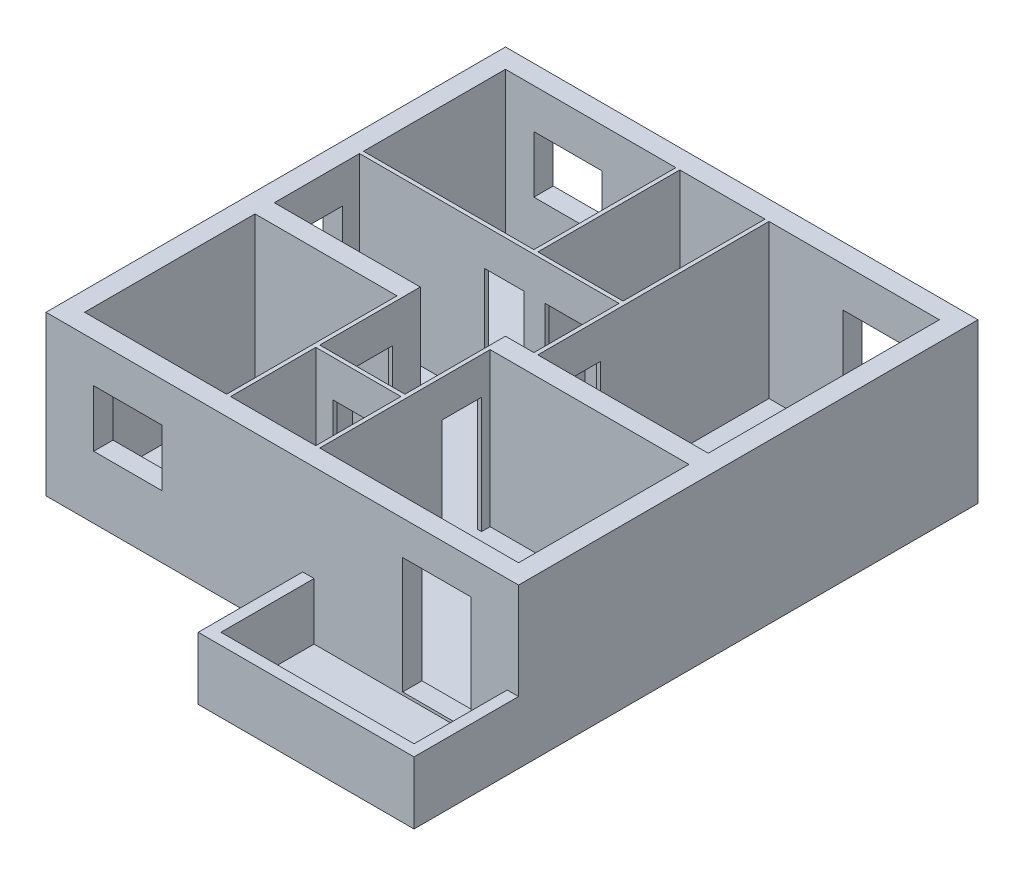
ISO-10303-21;
HEADER;
FILE_DESCRIPTION(('STEP AP214'),'2;1');
FILE_NAME('part.step','',(''),(''),'','','');
FILE_SCHEMA(('AUTOMOTIVE_DESIGN { 1 0 10303 214 1 1 1 1 }'));
ENDSEC;
DATA;
#1=APPLICATION_CONTEXT('core data for automotive mechanical design processes');
#2=APPLICATION_PROTOCOL_DEFINITION('international standard','automotive_design',2000,#1);
#3=PRODUCT_CONTEXT('',#1,'mechanical');
#4=PRODUCT('Part','Part','',(#3));
#5=PRODUCT_RELATED_PRODUCT_CATEGORY('part','',(#4));
#6=PRODUCT_DEFINITION_FORMATION('','',#4);
#7=PRODUCT_DEFINITION_CONTEXT('part definition',#1,'design');
#8=PRODUCT_DEFINITION('design','',#6,#7);
#9=PRODUCT_DEFINITION_SHAPE('','',#8);
#10=(LENGTH_UNIT() NAMED_UNIT(*) SI_UNIT(.MILLI.,.METRE.));
#11=(NAMED_UNIT(*) PLANE_ANGLE_UNIT() SI_UNIT($,.RADIAN.));
#12=(NAMED_UNIT(*) SI_UNIT($,.STERADIAN.) SOLID_ANGLE_UNIT());
#13=UNCERTAINTY_MEASURE_WITH_UNIT(LENGTH_MEASURE(1.E-05),#10,'distance_accuracy_value','');
#14=(GEOMETRIC_REPRESENTATION_CONTEXT(3) GLOBAL_UNCERTAINTY_ASSIGNED_CONTEXT((#13)) GLOBAL_UNIT_ASSIGNED_CONTEXT((#10,
#11,#12)) REPRESENTATION_CONTEXT('',''));
#15=CARTESIAN_POINT('',(0.,0.,0.));
#16=DIRECTION('',(0.,0.,1.));
#17=DIRECTION('',(1.,0.,0.));
#18=AXIS2_PLACEMENT_3D('',#15,#16,#17);
#19=CARTESIAN_POINT('',(-2840.,-2700.,3340.));
#20=DIRECTION('',(0.,0.,-1.));
#21=DIRECTION('',(-1.,0.,0.));
#22=AXIS2_PLACEMENT_3D('',#19,#20,#21);
#23=PLANE('',#22);
#24=DIRECTION('',(1.,0.,0.));
#25=VECTOR('',#24,1.);
#26=CARTESIAN_POINT('',(-2840.,-700.,3340.));
#27=LINE('',#26,#25);
#28=CARTESIAN_POINT('',(-2000.,-700.,3340.));
#29=VERTEX_POINT('',#28);
#30=CARTESIAN_POINT('',(-800.,-700.,3340.));
#31=VERTEX_POINT('',#30);
#32=EDGE_CURVE('E636',#29,#31,#27,.T.);
#33=ORIENTED_EDGE('',*,*,#32,.T.);
#34=DIRECTION('',(0.,-1.,0.));
#35=VECTOR('',#34,1.);
#36=CARTESIAN_POINT('',(-800.,-2700.,3340.));
#37=LINE('',#36,#35);
#38=CARTESIAN_POINT('',(-800.,-1700.,3340.));
#39=VERTEX_POINT('',#38);
#40=EDGE_CURVE('E639',#31,#39,#37,.T.);
#41=ORIENTED_EDGE('',*,*,#40,.T.);
#42=DIRECTION('',(-1.,0.,0.));
#43=VECTOR('',#42,1.);
#44=CARTESIAN_POINT('',(-2840.,-1700.,3340.));
#45=LINE('',#44,#43);
#46=CARTESIAN_POINT('',(-2000.,-1700.,3340.));
#47=VERTEX_POINT('',#46);
#48=EDGE_CURVE('E624',#39,#47,#45,.T.);
#49=ORIENTED_EDGE('',*,*,#48,.T.);
#50=DIRECTION('',(0.,1.,0.));
#51=VECTOR('',#50,1.);
#52=CARTESIAN_POINT('',(-2000.,-2700.,3340.));
#53=LINE('',#52,#51);
#54=EDGE_CURVE('E633',#47,#29,#53,.T.);
#55=ORIENTED_EDGE('',*,*,#54,.T.);
#56=EDGE_LOOP('',(#33,#41,#49,#55));
#57=FACE_BOUND('',#56,.T.);
#58=DIRECTION('',(1.,0.,0.));
#59=VECTOR('',#58,1.);
#60=CARTESIAN_POINT('',(-2840.,-600.000000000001,3340.));
#61=LINE('',#60,#59);
#62=CARTESIAN_POINT('',(3440.,-600.000000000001,3340.));
#63=VERTEX_POINT('',#62);
#64=CARTESIAN_POINT('',(4640.,-600.000000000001,3340.));
#65=VERTEX_POINT('',#64);
#66=EDGE_CURVE('E700',#63,#65,#61,.T.);
#67=ORIENTED_EDGE('',*,*,#66,.T.);
#68=DIRECTION('',(0.,-1.,0.));
#69=VECTOR('',#68,1.);
#70=CARTESIAN_POINT('',(4640.,-2700.,3340.));
#71=LINE('',#70,#69);
#72=CARTESIAN_POINT('',(4640.,-2650.,3340.));
#73=VERTEX_POINT('',#72);
#74=EDGE_CURVE('E703',#65,#73,#71,.T.);
#75=ORIENTED_EDGE('',*,*,#74,.T.);
#76=DIRECTION('',(-1.,0.,0.));
#77=VECTOR('',#76,1.);
#78=CARTESIAN_POINT('',(-2840.,-2650.,3340.));
#79=LINE('',#78,#77);
#80=CARTESIAN_POINT('',(3440.,-2650.,3340.));
#81=VERTEX_POINT('',#80);
#82=EDGE_CURVE('E688',#73,#81,#79,.T.);
#83=ORIENTED_EDGE('',*,*,#82,.T.);
#84=DIRECTION('',(0.,1.,0.));
#85=VECTOR('',#84,1.);
#86=CARTESIAN_POINT('',(3440.,-2700.,3340.));
#87=LINE('',#86,#85);
#88=EDGE_CURVE('E697',#81,#63,#87,.T.);
#89=ORIENTED_EDGE('',*,*,#88,.T.);
#90=EDGE_LOOP('',(#67,#75,#83,#89));
#91=FACE_BOUND('',#90,.T.);
#92=DIRECTION('',(0.,-1.,0.));
#93=VECTOR('',#92,1.);
#94=CARTESIAN_POINT('',(1880.,-1700.,3340.));
#95=LINE('',#94,#93);
#96=CARTESIAN_POINT('',(1880.,-1700.,3340.));
#97=VERTEX_POINT('',#96);
#98=CARTESIAN_POINT('',(1880.,-2700.,3340.));
#99=VERTEX_POINT('',#98);
#100=EDGE_CURVE('E889',#97,#99,#95,.T.);
#101=ORIENTED_EDGE('',*,*,#100,.T.);
#102=DIRECTION('',(-1.,0.,0.));
#103=VECTOR('',#102,1.);
#104=CARTESIAN_POINT('',(-2840.,-2700.,3340.));
#105=LINE('',#104,#103);
#106=CARTESIAN_POINT('',(5280.,-2700.,3340.));
#107=VERTEX_POINT('',#106);
#108=EDGE_CURVE('E1209',#107,#99,#105,.T.);
#109=ORIENTED_EDGE('',*,*,#108,.F.);
#110=DIRECTION('',(0.,-1.,0.));
#111=VECTOR('',#110,1.);
#112=CARTESIAN_POINT('',(5280.,-1700.,3340.));
#113=LINE('',#112,#111);
#114=CARTESIAN_POINT('',(5280.,-1700.,3340.));
#115=VERTEX_POINT('',#114);
#116=EDGE_CURVE('E902',#115,#107,#113,.T.);
#117=ORIENTED_EDGE('',*,*,#116,.F.);
#118=DIRECTION('',(-1.,0.,0.));
#119=VECTOR('',#118,1.);
#120=CARTESIAN_POINT('',(5480.,-1700.,3340.));
#121=LINE('',#120,#119);
#122=CARTESIAN_POINT('',(5480.,-1700.,3340.));
#123=VERTEX_POINT('',#122);
#124=EDGE_CURVE('E871',#123,#115,#121,.T.);
#125=ORIENTED_EDGE('',*,*,#124,.F.);
#126=DIRECTION('',(0.,1.,0.));
#127=VECTOR('',#126,1.);
#128=CARTESIAN_POINT('',(5480.,-2700.,3340.));
#129=LINE('',#128,#127);
#130=CARTESIAN_POINT('',(5480.,0.,3340.));
#131=VERTEX_POINT('',#130);
#132=EDGE_CURVE('E1224',#123,#131,#129,.T.);
#133=ORIENTED_EDGE('',*,*,#132,.T.);
#134=DIRECTION('',(-1.,0.,0.));
#135=VECTOR('',#134,1.);
#136=CARTESIAN_POINT('',(-2840.,0.,3340.));
#137=LINE('',#136,#135);
#138=CARTESIAN_POINT('',(-2840.,0.,3340.));
#139=VERTEX_POINT('',#138);
#140=EDGE_CURVE('E1213',#131,#139,#137,.T.);
#141=ORIENTED_EDGE('',*,*,#140,.T.);
#142=DIRECTION('',(0.,1.,0.));
#143=VECTOR('',#142,1.);
#144=CARTESIAN_POINT('',(-2840.,-2700.,3340.));
#145=LINE('',#144,#143);
#146=CARTESIAN_POINT('',(-2840.,-2800.,3340.));
#147=VERTEX_POINT('',#146);
#148=EDGE_CURVE('E1212',#147,#139,#145,.T.);
#149=ORIENTED_EDGE('',*,*,#148,.F.);
#150=DIRECTION('',(-1.,0.,0.));
#151=VECTOR('',#150,1.);
#152=CARTESIAN_POINT('',(1680.,-2800.,3340.));
#153=LINE('',#152,#151);
#154=CARTESIAN_POINT('',(1680.,-2800.,3340.));
#155=VERTEX_POINT('',#154);
#156=EDGE_CURVE('E910',#155,#147,#153,.T.);
#157=ORIENTED_EDGE('',*,*,#156,.F.);
#158=DIRECTION('',(0.,1.,0.));
#159=VECTOR('',#158,1.);
#160=CARTESIAN_POINT('',(1680.,-2800.,3340.));
#161=LINE('',#160,#159);
#162=CARTESIAN_POINT('',(1680.,-1700.,3340.));
#163=VERTEX_POINT('',#162);
#164=EDGE_CURVE('E919',#155,#163,#161,.T.);
#165=ORIENTED_EDGE('',*,*,#164,.T.);
#166=DIRECTION('',(-1.,0.,0.));
#167=VECTOR('',#166,1.);
#168=CARTESIAN_POINT('',(1680.,-1700.,3340.));
#169=LINE('',#168,#167);
#170=EDGE_CURVE('E880',#97,#163,#169,.T.);
#171=ORIENTED_EDGE('',*,*,#170,.F.);
#172=EDGE_LOOP('',(#101,#109,#117,#125,#133,#141,#149,#157,#165,#171));
#173=FACE_BOUND('',#172,.T.);
#174=ADVANCED_FACE('F35',(#57,#91,#173),#23,.F.);
#175=CARTESIAN_POINT('',(0.,-2700.,0.));
#176=DIRECTION('',(0.,-1.,0.));
#177=DIRECTION('',(0.,0.,-1.));
#178=AXIS2_PLACEMENT_3D('',#175,#176,#177);
#179=PLANE('',#178);
#180=DIRECTION('',(0.,0.,1.));
#181=VECTOR('',#180,1.);
#182=CARTESIAN_POINT('',(5280.,-2700.,4980.));
#183=LINE('',#182,#181);
#184=CARTESIAN_POINT('',(5280.,-2700.,4980.));
#185=VERTEX_POINT('',#184);
#186=EDGE_CURVE('E868',#107,#185,#183,.T.);
#187=ORIENTED_EDGE('',*,*,#186,.F.);
#188=ORIENTED_EDGE('',*,*,#108,.T.);
#189=DIRECTION('',(0.,0.,-1.));
#190=VECTOR('',#189,1.);
#191=CARTESIAN_POINT('',(1880.,-2700.,4980.));
#192=LINE('',#191,#190);
#193=CARTESIAN_POINT('',(1880.,-2700.,4980.));
#194=VERTEX_POINT('',#193);
#195=EDGE_CURVE('E872',#194,#99,#192,.T.);
#196=ORIENTED_EDGE('',*,*,#195,.F.);
#197=DIRECTION('',(-1.,0.,0.));
#198=VECTOR('',#197,1.);
#199=CARTESIAN_POINT('',(1880.,-2700.,4980.));
#200=LINE('',#199,#198);
#201=EDGE_CURVE('E891',#185,#194,#200,.T.);
#202=ORIENTED_EDGE('',*,*,#201,.F.);
#203=EDGE_LOOP('',(#187,#188,#196,#202));
#204=FACE_BOUND('',#203,.T.);
#205=ADVANCED_FACE('F1309',(#204),#179,.F.);
#206=CARTESIAN_POINT('',(0.,0.,0.));
#207=DIRECTION('',(0.,-1.,0.));
#208=DIRECTION('',(0.,0.,-1.));
#209=AXIS2_PLACEMENT_3D('',#206,#207,#208);
#210=PLANE('',#209);
#211=DIRECTION('',(0.,0.,1.));
#212=VECTOR('',#211,1.);
#213=CARTESIAN_POINT('',(500.000000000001,0.,-4410.));
#214=LINE('',#213,#212);
#215=CARTESIAN_POINT('',(500.000000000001,0.,-4410.));
#216=VERTEX_POINT('',#215);
#217=CARTESIAN_POINT('',(500.000000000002,0.,-1910.));
#218=VERTEX_POINT('',#217);
#219=EDGE_CURVE('E998',#216,#218,#214,.T.);
#220=ORIENTED_EDGE('',*,*,#219,.T.);
#221=DIRECTION('',(-1.,0.,0.));
#222=VECTOR('',#221,1.);
#223=CARTESIAN_POINT('',(500.000000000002,0.,-1910.));
#224=LINE('',#223,#222);
#225=CARTESIAN_POINT('',(-2500.,0.,-1910.));
#226=VERTEX_POINT('',#225);
#227=EDGE_CURVE('E1016',#218,#226,#224,.T.);
#228=ORIENTED_EDGE('',*,*,#227,.T.);
#229=DIRECTION('',(0.,0.,-1.));
#230=VECTOR('',#229,1.);
#231=CARTESIAN_POINT('',(-2500.,0.,-4410.));
#232=LINE('',#231,#230);
#233=CARTESIAN_POINT('',(-2500.,0.,-4410.));
#234=VERTEX_POINT('',#233);
#235=EDGE_CURVE('E1019',#226,#234,#232,.T.);
#236=ORIENTED_EDGE('',*,*,#235,.T.);
#237=DIRECTION('',(1.,0.,0.));
#238=VECTOR('',#237,1.);
#239=CARTESIAN_POINT('',(500.000000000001,0.,-4410.));
#240=LINE('',#239,#238);
#241=EDGE_CURVE('E1003',#234,#216,#240,.T.);
#242=ORIENTED_EDGE('',*,*,#241,.T.);
#243=EDGE_LOOP('',(#220,#228,#236,#242));
#244=FACE_BOUND('',#243,.T.);
#245=DIRECTION('',(0.,0.,-1.));
#246=VECTOR('',#245,1.);
#247=CARTESIAN_POINT('',(2140.,0.,-340.));
#248=LINE('',#247,#246);
#249=CARTESIAN_POINT('',(2140.,0.,-340.));
#250=VERTEX_POINT('',#249);
#251=CARTESIAN_POINT('',(2140.,0.,-4410.));
#252=VERTEX_POINT('',#251);
#253=EDGE_CURVE('E1068',#250,#252,#248,.T.);
#254=ORIENTED_EDGE('',*,*,#253,.T.);
#255=DIRECTION('',(1.,0.,0.));
#256=VECTOR('',#255,1.);
#257=CARTESIAN_POINT('',(2140.,0.,-4410.));
#258=LINE('',#257,#256);
#259=CARTESIAN_POINT('',(5140.,0.,-4410.));
#260=VERTEX_POINT('',#259);
#261=EDGE_CURVE('E1085',#252,#260,#258,.T.);
#262=ORIENTED_EDGE('',*,*,#261,.T.);
#263=DIRECTION('',(0.,0.,1.));
#264=VECTOR('',#263,1.);
#265=CARTESIAN_POINT('',(5140.,0.,-340.));
#266=LINE('',#265,#264);
#267=CARTESIAN_POINT('',(5140.,0.,-340.));
#268=VERTEX_POINT('',#267);
#269=EDGE_CURVE('E1088',#260,#268,#266,.T.);
#270=ORIENTED_EDGE('',*,*,#269,.T.);
#271=DIRECTION('',(-1.,0.,0.));
#272=VECTOR('',#271,1.);
#273=CARTESIAN_POINT('',(2140.,0.,-340.));
#274=LINE('',#273,#272);
#275=EDGE_CURVE('E1091',#268,#250,#274,.T.);
#276=ORIENTED_EDGE('',*,*,#275,.T.);
#277=EDGE_LOOP('',(#254,#262,#270,#276));
#278=FACE_BOUND('',#277,.T.);
#279=DIRECTION('',(0.,0.,-1.));
#280=VECTOR('',#279,1.);
#281=CARTESIAN_POINT('',(70.,0.,3000.));
#282=LINE('',#281,#280);
#283=CARTESIAN_POINT('',(70.,0.,3000.));
#284=VERTEX_POINT('',#283);
#285=CARTESIAN_POINT('',(70.0000000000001,0.,1500.));
#286=VERTEX_POINT('',#285);
#287=EDGE_CURVE('E1138',#284,#286,#282,.T.);
#288=ORIENTED_EDGE('',*,*,#287,.T.);
#289=DIRECTION('',(1.,0.,0.));
#290=VECTOR('',#289,1.);
#291=CARTESIAN_POINT('',(70.0000000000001,0.,1500.));
#292=LINE('',#291,#290);
#293=CARTESIAN_POINT('',(1570.,0.,1500.));
#294=VERTEX_POINT('',#293);
#295=EDGE_CURVE('E1156',#286,#294,#292,.T.);
#296=ORIENTED_EDGE('',*,*,#295,.T.);
#297=DIRECTION('',(0.,0.,1.));
#298=VECTOR('',#297,1.);
#299=CARTESIAN_POINT('',(1570.,0.,3000.));
#300=LINE('',#299,#298);
#301=CARTESIAN_POINT('',(1570.,0.,3000.));
#302=VERTEX_POINT('',#301);
#303=EDGE_CURVE('E1159',#294,#302,#300,.T.);
#304=ORIENTED_EDGE('',*,*,#303,.T.);
#305=DIRECTION('',(-1.,0.,0.));
#306=VECTOR('',#305,1.);
#307=CARTESIAN_POINT('',(70.,0.,3000.));
#308=LINE('',#307,#306);
#309=EDGE_CURVE('E1143',#302,#284,#308,.T.);
#310=ORIENTED_EDGE('',*,*,#309,.T.);
#311=EDGE_LOOP('',(#288,#296,#304,#310));
#312=FACE_BOUND('',#311,.T.);
#313=DIRECTION('',(0.,0.,-1.));
#314=VECTOR('',#313,1.);
#315=CARTESIAN_POINT('',(-2840.,0.,3340.));
#316=LINE('',#315,#314);
#317=CARTESIAN_POINT('',(-2840.,0.,-4750.));
#318=VERTEX_POINT('',#317);
#319=EDGE_CURVE('E1208',#139,#318,#316,.T.);
#320=ORIENTED_EDGE('',*,*,#319,.F.);
#321=ORIENTED_EDGE('',*,*,#140,.F.);
#322=DIRECTION('',(0.,0.,1.));
#323=VECTOR('',#322,1.);
#324=CARTESIAN_POINT('',(5480.,0.,3340.));
#325=LINE('',#324,#323);
#326=CARTESIAN_POINT('',(5480.,0.,-4750.));
#327=VERTEX_POINT('',#326);
#328=EDGE_CURVE('E1218',#327,#131,#325,.T.);
#329=ORIENTED_EDGE('',*,*,#328,.F.);
#330=DIRECTION('',(1.,0.,0.));
#331=VECTOR('',#330,1.);
#332=CARTESIAN_POINT('',(-2840.,0.,-4750.));
#333=LINE('',#332,#331);
#334=EDGE_CURVE('E1216',#318,#327,#333,.T.);
#335=ORIENTED_EDGE('',*,*,#334,.F.);
#336=EDGE_LOOP('',(#320,#321,#329,#335));
#337=FACE_BOUND('',#336,.T.);
#338=DIRECTION('',(0.,0.,1.));
#339=VECTOR('',#338,1.);
#340=CARTESIAN_POINT('',(0.,0.,0.));
#341=LINE('',#340,#339);
#342=CARTESIAN_POINT('',(0.,0.,0.));
#343=VERTEX_POINT('',#342);
#344=CARTESIAN_POINT('',(0.,0.,3000.));
#345=VERTEX_POINT('',#344);
#346=EDGE_CURVE('E1173',#343,#345,#341,.T.);
#347=ORIENTED_EDGE('',*,*,#346,.T.);
#348=DIRECTION('',(-1.,0.,0.));
#349=VECTOR('',#348,1.);
#350=CARTESIAN_POINT('',(0.,0.,3000.));
#351=LINE('',#350,#349);
#352=CARTESIAN_POINT('',(-2500.,0.,3000.));
#353=VERTEX_POINT('',#352);
#354=EDGE_CURVE('E1190',#345,#353,#351,.T.);
#355=ORIENTED_EDGE('',*,*,#354,.T.);
#356=DIRECTION('',(0.,0.,-1.));
#357=VECTOR('',#356,1.);
#358=CARTESIAN_POINT('',(-2500.,0.,0.));
#359=LINE('',#358,#357);
#360=CARTESIAN_POINT('',(-2500.,0.,0.));
#361=VERTEX_POINT('',#360);
#362=EDGE_CURVE('E1193',#353,#361,#359,.T.);
#363=ORIENTED_EDGE('',*,*,#362,.T.);
#364=DIRECTION('',(1.,0.,0.));
#365=VECTOR('',#364,1.);
#366=CARTESIAN_POINT('',(0.,0.,0.));
#367=LINE('',#366,#365);
#368=EDGE_CURVE('E1196',#361,#343,#367,.T.);
#369=ORIENTED_EDGE('',*,*,#368,.T.);
#370=EDGE_LOOP('',(#347,#355,#363,#369));
#371=FACE_BOUND('',#370,.T.);
#372=DIRECTION('',(0.,0.,-1.));
#373=VECTOR('',#372,1.);
#374=CARTESIAN_POINT('',(1640.,0.,3000.));
#375=LINE('',#374,#373);
#376=CARTESIAN_POINT('',(1640.,0.,3000.));
#377=VERTEX_POINT('',#376);
#378=CARTESIAN_POINT('',(1640.,0.,4.44089209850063E-13));
#379=VERTEX_POINT('',#378);
#380=EDGE_CURVE('E1103',#377,#379,#375,.T.);
#381=ORIENTED_EDGE('',*,*,#380,.T.);
#382=DIRECTION('',(1.,0.,0.));
#383=VECTOR('',#382,1.);
#384=CARTESIAN_POINT('',(1640.,0.,4.44089209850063E-13));
#385=LINE('',#384,#383);
#386=CARTESIAN_POINT('',(5140.,0.,4.44089209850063E-13));
#387=VERTEX_POINT('',#386);
#388=EDGE_CURVE('E1120',#379,#387,#385,.T.);
#389=ORIENTED_EDGE('',*,*,#388,.T.);
#390=DIRECTION('',(0.,0.,1.));
#391=VECTOR('',#390,1.);
#392=CARTESIAN_POINT('',(5140.,0.,3000.));
#393=LINE('',#392,#391);
#394=CARTESIAN_POINT('',(5140.,0.,3000.));
#395=VERTEX_POINT('',#394);
#396=EDGE_CURVE('E1123',#387,#395,#393,.T.);
#397=ORIENTED_EDGE('',*,*,#396,.T.);
#398=DIRECTION('',(-1.,0.,0.));
#399=VECTOR('',#398,1.);
#400=CARTESIAN_POINT('',(1640.,0.,3000.));
#401=LINE('',#400,#399);
#402=EDGE_CURVE('E1126',#395,#377,#401,.T.);
#403=ORIENTED_EDGE('',*,*,#402,.T.);
#404=EDGE_LOOP('',(#381,#389,#397,#403));
#405=FACE_BOUND('',#404,.T.);
#406=DIRECTION('',(0.,0.,1.));
#407=VECTOR('',#406,1.);
#408=CARTESIAN_POINT('',(2070.,0.,-4410.));
#409=LINE('',#408,#407);
#410=CARTESIAN_POINT('',(2070.,0.,-4410.));
#411=VERTEX_POINT('',#410);
#412=CARTESIAN_POINT('',(2070.,0.,-1910.));
#413=VERTEX_POINT('',#412);
#414=EDGE_CURVE('E1033',#411,#413,#409,.T.);
#415=ORIENTED_EDGE('',*,*,#414,.T.);
#416=DIRECTION('',(-1.,0.,0.));
#417=VECTOR('',#416,1.);
#418=CARTESIAN_POINT('',(2070.,0.,-1910.));
#419=LINE('',#418,#417);
#420=CARTESIAN_POINT('',(570.000000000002,0.,-1910.));
#421=VERTEX_POINT('',#420);
#422=EDGE_CURVE('E1051',#413,#421,#419,.T.);
#423=ORIENTED_EDGE('',*,*,#422,.T.);
#424=DIRECTION('',(0.,0.,-1.));
#425=VECTOR('',#424,1.);
#426=CARTESIAN_POINT('',(570.000000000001,0.,-4410.));
#427=LINE('',#426,#425);
#428=CARTESIAN_POINT('',(570.000000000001,0.,-4410.));
#429=VERTEX_POINT('',#428);
#430=EDGE_CURVE('E1054',#421,#429,#427,.T.);
#431=ORIENTED_EDGE('',*,*,#430,.T.);
#432=DIRECTION('',(1.,0.,0.));
#433=VECTOR('',#432,1.);
#434=CARTESIAN_POINT('',(2070.,0.,-4410.));
#435=LINE('',#434,#433);
#436=EDGE_CURVE('E1038',#429,#411,#435,.T.);
#437=ORIENTED_EDGE('',*,*,#436,.T.);
#438=EDGE_LOOP('',(#415,#423,#431,#437));
#439=FACE_BOUND('',#438,.T.);
#440=DIRECTION('',(1.,0.,0.));
#441=VECTOR('',#440,1.);
#442=CARTESIAN_POINT('',(-2500.,0.,-1840.));
#443=LINE('',#442,#441);
#444=CARTESIAN_POINT('',(-2500.,0.,-1840.));
#445=VERTEX_POINT('',#444);
#446=CARTESIAN_POINT('',(2070.,0.,-1840.));
#447=VERTEX_POINT('',#446);
#448=EDGE_CURVE('E925',#445,#447,#443,.T.);
#449=ORIENTED_EDGE('',*,*,#448,.T.);
#450=DIRECTION('',(0.,0.,1.));
#451=VECTOR('',#450,1.);
#452=CARTESIAN_POINT('',(2070.,0.,-1840.));
#453=LINE('',#452,#451);
#454=CARTESIAN_POINT('',(2070.,0.,-340.000000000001));
#455=VERTEX_POINT('',#454);
#456=EDGE_CURVE('E960',#447,#455,#453,.T.);
#457=ORIENTED_EDGE('',*,*,#456,.T.);
#458=DIRECTION('',(-1.,0.,0.));
#459=VECTOR('',#458,1.);
#460=CARTESIAN_POINT('',(2070.,0.,-340.000000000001));
#461=LINE('',#460,#459);
#462=CARTESIAN_POINT('',(1570.,0.,-340.));
#463=VERTEX_POINT('',#462);
#464=EDGE_CURVE('E963',#455,#463,#461,.T.);
#465=ORIENTED_EDGE('',*,*,#464,.T.);
#466=DIRECTION('',(0.,0.,1.));
#467=VECTOR('',#466,1.);
#468=CARTESIAN_POINT('',(1570.,0.,-340.));
#469=LINE('',#468,#467);
#470=CARTESIAN_POINT('',(1570.,0.,1430.));
#471=VERTEX_POINT('',#470);
#472=EDGE_CURVE('E966',#463,#471,#469,.T.);
#473=ORIENTED_EDGE('',*,*,#472,.T.);
#474=DIRECTION('',(-1.,0.,0.));
#475=VECTOR('',#474,1.);
#476=CARTESIAN_POINT('',(1570.,0.,1430.));
#477=LINE('',#476,#475);
#478=CARTESIAN_POINT('',(69.9999999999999,0.,1430.));
#479=VERTEX_POINT('',#478);
#480=EDGE_CURVE('E969',#471,#479,#477,.T.);
#481=ORIENTED_EDGE('',*,*,#480,.T.);
#482=DIRECTION('',(0.,0.,-1.));
#483=VECTOR('',#482,1.);
#484=CARTESIAN_POINT('',(69.9999999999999,0.,1430.));
#485=LINE('',#484,#483);
#486=CARTESIAN_POINT('',(70.0000000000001,0.,-340.));
#487=VERTEX_POINT('',#486);
#488=EDGE_CURVE('E972',#479,#487,#485,.T.);
#489=ORIENTED_EDGE('',*,*,#488,.T.);
#490=DIRECTION('',(-1.,0.,0.));
#491=VECTOR('',#490,1.);
#492=CARTESIAN_POINT('',(70.0000000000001,0.,-340.));
#493=LINE('',#492,#491);
#494=CARTESIAN_POINT('',(-2500.,0.,-340.));
#495=VERTEX_POINT('',#494);
#496=EDGE_CURVE('E975',#487,#495,#493,.T.);
#497=ORIENTED_EDGE('',*,*,#496,.T.);
#498=DIRECTION('',(0.,0.,-1.));
#499=VECTOR('',#498,1.);
#500=CARTESIAN_POINT('',(-2500.,0.,-340.));
#501=LINE('',#500,#499);
#502=EDGE_CURVE('E978',#495,#445,#501,.T.);
#503=ORIENTED_EDGE('',*,*,#502,.T.);
#504=EDGE_LOOP('',(#449,#457,#465,#473,#481,#489,#497,#503));
#505=FACE_BOUND('',#504,.T.);
#506=ADVANCED_FACE('F1261',(#244,#278,#312,#337,#371,#405,#439,#505),#210,.F.);
#507=CARTESIAN_POINT('',(-2840.,-2700.,3340.));
#508=DIRECTION('',(1.,0.,0.));
#509=DIRECTION('',(0.,0.,-1.));
#510=AXIS2_PLACEMENT_3D('',#507,#508,#509);
#511=PLANE('',#510);
#512=DIRECTION('',(0.,0.,1.));
#513=VECTOR('',#512,1.);
#514=CARTESIAN_POINT('',(-2840.,-650.,3340.));
#515=LINE('',#514,#513);
#516=CARTESIAN_POINT('',(-2840.,-650.,-1540.));
#517=VERTEX_POINT('',#516);
#518=CARTESIAN_POINT('',(-2840.,-650.,-640.));
#519=VERTEX_POINT('',#518);
#520=EDGE_CURVE('E862',#517,#519,#515,.T.);
#521=ORIENTED_EDGE('',*,*,#520,.T.);
#522=DIRECTION('',(0.,-1.,0.));
#523=VECTOR('',#522,1.);
#524=CARTESIAN_POINT('',(-2840.,-2700.,-640.));
#525=LINE('',#524,#523);
#526=CARTESIAN_POINT('',(-2840.,-2700.,-640.));
#527=VERTEX_POINT('',#526);
#528=EDGE_CURVE('E865',#519,#527,#525,.T.);
#529=ORIENTED_EDGE('',*,*,#528,.T.);
#530=DIRECTION('',(0.,0.,-1.));
#531=VECTOR('',#530,1.);
#532=CARTESIAN_POINT('',(-2840.,-2700.,3340.));
#533=LINE('',#532,#531);
#534=CARTESIAN_POINT('',(-2840.,-2700.,-1540.));
#535=VERTEX_POINT('',#534);
#536=EDGE_CURVE('E850',#527,#535,#533,.T.);
#537=ORIENTED_EDGE('',*,*,#536,.T.);
#538=DIRECTION('',(0.,1.,0.));
#539=VECTOR('',#538,1.);
#540=CARTESIAN_POINT('',(-2840.,-2700.,-1540.));
#541=LINE('',#540,#539);
#542=EDGE_CURVE('E859',#535,#517,#541,.T.);
#543=ORIENTED_EDGE('',*,*,#542,.T.);
#544=EDGE_LOOP('',(#521,#529,#537,#543));
#545=FACE_BOUND('',#544,.T.);
#546=ORIENTED_EDGE('',*,*,#319,.T.);
#547=DIRECTION('',(0.,1.,0.));
#548=VECTOR('',#547,1.);
#549=CARTESIAN_POINT('',(-2840.,-2700.,-4750.));
#550=LINE('',#549,#548);
#551=CARTESIAN_POINT('',(-2840.,-2800.,-4750.));
#552=VERTEX_POINT('',#551);
#553=EDGE_CURVE('E1229',#552,#318,#550,.T.);
#554=ORIENTED_EDGE('',*,*,#553,.F.);
#555=DIRECTION('',(0.,0.,-1.));
#556=VECTOR('',#555,1.);
#557=CARTESIAN_POINT('',(-2840.,-2800.,-4750.));
#558=LINE('',#557,#556);
#559=EDGE_CURVE('E913',#147,#552,#558,.T.);
#560=ORIENTED_EDGE('',*,*,#559,.F.);
#561=ORIENTED_EDGE('',*,*,#148,.T.);
#562=EDGE_LOOP('',(#546,#554,#560,#561));
#563=FACE_BOUND('',#562,.T.);
#564=ADVANCED_FACE('F37',(#545,#563),#511,.F.);
#565=CARTESIAN_POINT('',(-2840.,-2700.,-4750.));
#566=DIRECTION('',(0.,0.,1.));
#567=DIRECTION('',(1.,0.,0.));
#568=AXIS2_PLACEMENT_3D('',#565,#566,#567);
#569=PLANE('',#568);
#570=DIRECTION('',(-1.,0.,0.));
#571=VECTOR('',#570,1.);
#572=CARTESIAN_POINT('',(-2840.,-700.,-4750.));
#573=LINE('',#572,#571);
#574=CARTESIAN_POINT('',(-799.999999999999,-700.,-4750.));
#575=VERTEX_POINT('',#574);
#576=CARTESIAN_POINT('',(-2000.,-700.,-4750.));
#577=VERTEX_POINT('',#576);
#578=EDGE_CURVE('E604',#575,#577,#573,.T.);
#579=ORIENTED_EDGE('',*,*,#578,.T.);
#580=DIRECTION('',(0.,-1.,0.));
#581=VECTOR('',#580,1.);
#582=CARTESIAN_POINT('',(-2000.,-2700.,-4750.));
#583=LINE('',#582,#581);
#584=CARTESIAN_POINT('',(-2000.,-1700.,-4750.));
#585=VERTEX_POINT('',#584);
#586=EDGE_CURVE('E607',#577,#585,#583,.T.);
#587=ORIENTED_EDGE('',*,*,#586,.T.);
#588=DIRECTION('',(1.,0.,0.));
#589=VECTOR('',#588,1.);
#590=CARTESIAN_POINT('',(-2840.,-1700.,-4750.));
#591=LINE('',#590,#589);
#592=CARTESIAN_POINT('',(-799.999999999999,-1700.,-4750.));
#593=VERTEX_POINT('',#592);
#594=EDGE_CURVE('E599',#585,#593,#591,.T.);
#595=ORIENTED_EDGE('',*,*,#594,.T.);
#596=DIRECTION('',(0.,1.,0.));
#597=VECTOR('',#596,1.);
#598=CARTESIAN_POINT('',(-799.999999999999,-2700.,-4750.));
#599=LINE('',#598,#597);
#600=EDGE_CURVE('E579',#593,#575,#599,.T.);
#601=ORIENTED_EDGE('',*,*,#600,.T.);
#602=EDGE_LOOP('',(#579,#587,#595,#601));
#603=FACE_BOUND('',#602,.T.);
#604=DIRECTION('',(1.,0.,0.));
#605=VECTOR('',#604,1.);
#606=CARTESIAN_POINT('',(-2840.,-1700.,-4750.));
#607=LINE('',#606,#605);
#608=CARTESIAN_POINT('',(3440.,-1700.,-4750.));
#609=VERTEX_POINT('',#608);
#610=CARTESIAN_POINT('',(4640.,-1700.,-4750.));
#611=VERTEX_POINT('',#610);
#612=EDGE_CURVE('E668',#609,#611,#607,.T.);
#613=ORIENTED_EDGE('',*,*,#612,.T.);
#614=DIRECTION('',(0.,1.,0.));
#615=VECTOR('',#614,1.);
#616=CARTESIAN_POINT('',(4640.,-2700.,-4750.));
#617=LINE('',#616,#615);
#618=CARTESIAN_POINT('',(4640.,-700.,-4750.));
#619=VERTEX_POINT('',#618);
#620=EDGE_CURVE('E671',#611,#619,#617,.T.);
#621=ORIENTED_EDGE('',*,*,#620,.T.);
#622=DIRECTION('',(-1.,0.,0.));
#623=VECTOR('',#622,1.);
#624=CARTESIAN_POINT('',(-2840.,-700.000000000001,-4750.));
#625=LINE('',#624,#623);
#626=CARTESIAN_POINT('',(3440.,-700.,-4750.));
#627=VERTEX_POINT('',#626);
#628=EDGE_CURVE('E656',#619,#627,#625,.T.);
#629=ORIENTED_EDGE('',*,*,#628,.T.);
#630=DIRECTION('',(0.,-1.,0.));
#631=VECTOR('',#630,1.);
#632=CARTESIAN_POINT('',(3440.,-2700.,-4750.));
#633=LINE('',#632,#631);
#634=EDGE_CURVE('E665',#627,#609,#633,.T.);
#635=ORIENTED_EDGE('',*,*,#634,.T.);
#636=EDGE_LOOP('',(#613,#621,#629,#635));
#637=FACE_BOUND('',#636,.T.);
#638=ORIENTED_EDGE('',*,*,#334,.T.);
#639=DIRECTION('',(0.,1.,0.));
#640=VECTOR('',#639,1.);
#641=CARTESIAN_POINT('',(5480.,-2700.,-4750.));
#642=LINE('',#641,#640);
#643=CARTESIAN_POINT('',(5480.,-2800.,-4750.));
#644=VERTEX_POINT('',#643);
#645=EDGE_CURVE('E1226',#644,#327,#642,.T.);
#646=ORIENTED_EDGE('',*,*,#645,.F.);
#647=DIRECTION('',(1.,0.,0.));
#648=VECTOR('',#647,1.);
#649=CARTESIAN_POINT('',(5480.,-2800.,-4750.));
#650=LINE('',#649,#648);
#651=EDGE_CURVE('E916',#552,#644,#650,.T.);
#652=ORIENTED_EDGE('',*,*,#651,.F.);
#653=ORIENTED_EDGE('',*,*,#553,.T.);
#654=EDGE_LOOP('',(#638,#646,#652,#653));
#655=FACE_BOUND('',#654,.T.);
#656=ADVANCED_FACE('F1324',(#603,#637,#655),#569,.F.);
#657=CARTESIAN_POINT('',(5480.,-2700.,3340.));
#658=DIRECTION('',(-1.,0.,0.));
#659=DIRECTION('',(0.,0.,1.));
#660=AXIS2_PLACEMENT_3D('',#657,#658,#659);
#661=PLANE('',#660);
#662=ORIENTED_EDGE('',*,*,#132,.F.);
#663=DIRECTION('',(0.,0.,-1.));
#664=VECTOR('',#663,1.);
#665=CARTESIAN_POINT('',(5480.,-1700.,5180.));
#666=LINE('',#665,#664);
#667=CARTESIAN_POINT('',(5480.,-1700.,5180.));
#668=VERTEX_POINT('',#667);
#669=EDGE_CURVE('E869',#668,#123,#666,.T.);
#670=ORIENTED_EDGE('',*,*,#669,.F.);
#671=DIRECTION('',(0.,1.,0.));
#672=VECTOR('',#671,1.);
#673=CARTESIAN_POINT('',(5480.,-2800.,5180.));
#674=LINE('',#673,#672);
#675=CARTESIAN_POINT('',(5480.,-2800.,5180.));
#676=VERTEX_POINT('',#675);
#677=EDGE_CURVE('E923',#676,#668,#674,.T.);
#678=ORIENTED_EDGE('',*,*,#677,.F.);
#679=DIRECTION('',(0.,0.,1.));
#680=VECTOR('',#679,1.);
#681=CARTESIAN_POINT('',(5480.,-2800.,-4750.));
#682=LINE('',#681,#680);
#683=EDGE_CURVE('E904',#644,#676,#682,.T.);
#684=ORIENTED_EDGE('',*,*,#683,.F.);
#685=ORIENTED_EDGE('',*,*,#645,.T.);
#686=ORIENTED_EDGE('',*,*,#328,.T.);
#687=EDGE_LOOP('',(#662,#670,#678,#684,#685,#686));
#688=FACE_BOUND('',#687,.T.);
#689=ADVANCED_FACE('F1321',(#688),#661,.F.);
#690=CARTESIAN_POINT('',(0.,-2700.,0.));
#691=DIRECTION('',(-1.,0.,0.));
#692=DIRECTION('',(0.,0.,1.));
#693=AXIS2_PLACEMENT_3D('',#690,#691,#692);
#694=PLANE('',#693);
#695=DIRECTION('',(0.,-1.,0.));
#696=VECTOR('',#695,1.);
#697=CARTESIAN_POINT('',(0.,-2700.,150.));
#698=LINE('',#697,#696);
#699=CARTESIAN_POINT('',(0.,-650.,150.));
#700=VERTEX_POINT('',#699);
#701=CARTESIAN_POINT('',(0.,-2700.,150.));
#702=VERTEX_POINT('',#701);
#703=EDGE_CURVE('E809',#700,#702,#698,.T.);
#704=ORIENTED_EDGE('',*,*,#703,.F.);
#705=DIRECTION('',(0.,0.,-1.));
#706=VECTOR('',#705,1.);
#707=CARTESIAN_POINT('',(0.,-650.,3.25136742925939E-13));
#708=LINE('',#707,#706);
#709=CARTESIAN_POINT('',(0.,-650.,850.));
#710=VERTEX_POINT('',#709);
#711=EDGE_CURVE('E813',#710,#700,#708,.T.);
#712=ORIENTED_EDGE('',*,*,#711,.F.);
#713=DIRECTION('',(0.,1.,0.));
#714=VECTOR('',#713,1.);
#715=CARTESIAN_POINT('',(0.,-2700.,850.));
#716=LINE('',#715,#714);
#717=CARTESIAN_POINT('',(0.,-2700.,850.));
#718=VERTEX_POINT('',#717);
#719=EDGE_CURVE('E801',#718,#710,#716,.T.);
#720=ORIENTED_EDGE('',*,*,#719,.F.);
#721=DIRECTION('',(0.,0.,1.));
#722=VECTOR('',#721,1.);
#723=CARTESIAN_POINT('',(0.,-2700.,0.));
#724=LINE('',#723,#722);
#725=CARTESIAN_POINT('',(0.,-2700.,3000.));
#726=VERTEX_POINT('',#725);
#727=EDGE_CURVE('E1178',#718,#726,#724,.T.);
#728=ORIENTED_EDGE('',*,*,#727,.T.);
#729=DIRECTION('',(0.,1.,0.));
#730=VECTOR('',#729,1.);
#731=CARTESIAN_POINT('',(0.,-2700.,3000.));
#732=LINE('',#731,#730);
#733=EDGE_CURVE('E1205',#726,#345,#732,.T.);
#734=ORIENTED_EDGE('',*,*,#733,.T.);
#735=ORIENTED_EDGE('',*,*,#346,.F.);
#736=DIRECTION('',(0.,1.,0.));
#737=VECTOR('',#736,1.);
#738=CARTESIAN_POINT('',(0.,-2700.,0.));
#739=LINE('',#738,#737);
#740=CARTESIAN_POINT('',(0.,-2700.,0.));
#741=VERTEX_POINT('',#740);
#742=EDGE_CURVE('E1187',#741,#343,#739,.T.);
#743=ORIENTED_EDGE('',*,*,#742,.F.);
#744=EDGE_CURVE('E1174',#741,#702,#724,.T.);
#745=ORIENTED_EDGE('',*,*,#744,.T.);
#746=EDGE_LOOP('',(#704,#712,#720,#728,#734,#735,#743,#745));
#747=FACE_BOUND('',#746,.T.);
#748=ADVANCED_FACE('F1323',(#747),#694,.T.);
#749=CARTESIAN_POINT('',(0.,-2700.,3000.));
#750=DIRECTION('',(0.,0.,-1.));
#751=DIRECTION('',(-1.,0.,0.));
#752=AXIS2_PLACEMENT_3D('',#749,#750,#751);
#753=PLANE('',#752);
#754=DIRECTION('',(0.,-1.,0.));
#755=VECTOR('',#754,1.);
#756=CARTESIAN_POINT('',(-800.,-700.,3000.));
#757=LINE('',#756,#755);
#758=CARTESIAN_POINT('',(-800.,-700.,3000.));
#759=VERTEX_POINT('',#758);
#760=CARTESIAN_POINT('',(-800.,-1700.,3000.));
#761=VERTEX_POINT('',#760);
#762=EDGE_CURVE('E610',#759,#761,#757,.T.);
#763=ORIENTED_EDGE('',*,*,#762,.F.);
#764=DIRECTION('',(1.,0.,0.));
#765=VECTOR('',#764,1.);
#766=CARTESIAN_POINT('',(-800.,-700.,3000.));
#767=LINE('',#766,#765);
#768=CARTESIAN_POINT('',(-2000.,-700.,3000.));
#769=VERTEX_POINT('',#768);
#770=EDGE_CURVE('E618',#769,#759,#767,.T.);
#771=ORIENTED_EDGE('',*,*,#770,.F.);
#772=DIRECTION('',(0.,1.,0.));
#773=VECTOR('',#772,1.);
#774=CARTESIAN_POINT('',(-2000.,-700.,3000.));
#775=LINE('',#774,#773);
#776=CARTESIAN_POINT('',(-2000.,-1700.,3000.));
#777=VERTEX_POINT('',#776);
#778=EDGE_CURVE('E615',#777,#769,#775,.T.);
#779=ORIENTED_EDGE('',*,*,#778,.F.);
#780=DIRECTION('',(-1.,0.,0.));
#781=VECTOR('',#780,1.);
#782=CARTESIAN_POINT('',(-800.,-1700.,3000.));
#783=LINE('',#782,#781);
#784=EDGE_CURVE('E612',#761,#777,#783,.T.);
#785=ORIENTED_EDGE('',*,*,#784,.F.);
#786=EDGE_LOOP('',(#763,#771,#779,#785));
#787=FACE_BOUND('',#786,.T.);
#788=ORIENTED_EDGE('',*,*,#354,.F.);
#789=ORIENTED_EDGE('',*,*,#733,.F.);
#790=DIRECTION('',(-1.,0.,0.));
#791=VECTOR('',#790,1.);
#792=CARTESIAN_POINT('',(0.,-2700.,3000.));
#793=LINE('',#792,#791);
#794=CARTESIAN_POINT('',(-2500.,-2700.,3000.));
#795=VERTEX_POINT('',#794);
#796=EDGE_CURVE('E1177',#726,#795,#793,.T.);
#797=ORIENTED_EDGE('',*,*,#796,.T.);
#798=DIRECTION('',(0.,1.,0.));
#799=VECTOR('',#798,1.);
#800=CARTESIAN_POINT('',(-2500.,-2700.,3000.));
#801=LINE('',#800,#799);
#802=EDGE_CURVE('E1203',#795,#353,#801,.T.);
#803=ORIENTED_EDGE('',*,*,#802,.T.);
#804=EDGE_LOOP('',(#788,#789,#797,#803));
#805=FACE_BOUND('',#804,.T.);
#806=ADVANCED_FACE('F1542',(#787,#805),#753,.T.);
#807=CARTESIAN_POINT('',(-2500.,-2700.,0.));
#808=DIRECTION('',(1.,0.,0.));
#809=DIRECTION('',(0.,0.,-1.));
#810=AXIS2_PLACEMENT_3D('',#807,#808,#809);
#811=PLANE('',#810);
#812=ORIENTED_EDGE('',*,*,#362,.F.);
#813=ORIENTED_EDGE('',*,*,#802,.F.);
#814=DIRECTION('',(0.,0.,-1.));
#815=VECTOR('',#814,1.);
#816=CARTESIAN_POINT('',(-2500.,-2700.,0.));
#817=LINE('',#816,#815);
#818=CARTESIAN_POINT('',(-2500.,-2700.,0.));
#819=VERTEX_POINT('',#818);
#820=EDGE_CURVE('E1181',#795,#819,#817,.T.);
#821=ORIENTED_EDGE('',*,*,#820,.T.);
#822=DIRECTION('',(0.,1.,0.));
#823=VECTOR('',#822,1.);
#824=CARTESIAN_POINT('',(-2500.,-2700.,0.));
#825=LINE('',#824,#823);
#826=EDGE_CURVE('E1201',#819,#361,#825,.T.);
#827=ORIENTED_EDGE('',*,*,#826,.T.);
#828=EDGE_LOOP('',(#812,#813,#821,#827));
#829=FACE_BOUND('',#828,.T.);
#830=ADVANCED_FACE('F1550',(#829),#811,.T.);
#831=CARTESIAN_POINT('',(0.,-2700.,0.));
#832=DIRECTION('',(0.,0.,1.));
#833=DIRECTION('',(1.,0.,0.));
#834=AXIS2_PLACEMENT_3D('',#831,#832,#833);
#835=PLANE('',#834);
#836=ORIENTED_EDGE('',*,*,#368,.F.);
#837=ORIENTED_EDGE('',*,*,#826,.F.);
#838=DIRECTION('',(1.,0.,0.));
#839=VECTOR('',#838,1.);
#840=CARTESIAN_POINT('',(0.,-2700.,0.));
#841=LINE('',#840,#839);
#842=EDGE_CURVE('E1184',#819,#741,#841,.T.);
#843=ORIENTED_EDGE('',*,*,#842,.T.);
#844=ORIENTED_EDGE('',*,*,#742,.T.);
#845=EDGE_LOOP('',(#836,#837,#843,#844));
#846=FACE_BOUND('',#845,.T.);
#847=ADVANCED_FACE('F1558',(#846),#835,.T.);
#848=CARTESIAN_POINT('',(70.,-2700.,3000.));
#849=DIRECTION('',(1.,0.,0.));
#850=DIRECTION('',(0.,0.,-1.));
#851=AXIS2_PLACEMENT_3D('',#848,#849,#850);
#852=PLANE('',#851);
#853=ORIENTED_EDGE('',*,*,#287,.F.);
#854=DIRECTION('',(0.,1.,0.));
#855=VECTOR('',#854,1.);
#856=CARTESIAN_POINT('',(70.,-2700.,3000.));
#857=LINE('',#856,#855);
#858=CARTESIAN_POINT('',(70.,-2700.,3000.));
#859=VERTEX_POINT('',#858);
#860=EDGE_CURVE('E1153',#859,#284,#857,.T.);
#861=ORIENTED_EDGE('',*,*,#860,.F.);
#862=DIRECTION('',(0.,0.,-1.));
#863=VECTOR('',#862,1.);
#864=CARTESIAN_POINT('',(70.,-2700.,3000.));
#865=LINE('',#864,#863);
#866=CARTESIAN_POINT('',(70.0000000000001,-2700.,1500.));
#867=VERTEX_POINT('',#866);
#868=EDGE_CURVE('E1139',#859,#867,#865,.T.);
#869=ORIENTED_EDGE('',*,*,#868,.T.);
#870=DIRECTION('',(0.,1.,0.));
#871=VECTOR('',#870,1.);
#872=CARTESIAN_POINT('',(70.0000000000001,-2700.,1500.));
#873=LINE('',#872,#871);
#874=EDGE_CURVE('E1170',#867,#286,#873,.T.);
#875=ORIENTED_EDGE('',*,*,#874,.T.);
#876=EDGE_LOOP('',(#853,#861,#869,#875));
#877=FACE_BOUND('',#876,.T.);
#878=ADVANCED_FACE('F1566',(#877),#852,.T.);
#879=CARTESIAN_POINT('',(70.0000000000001,-2700.,1500.));
#880=DIRECTION('',(0.,0.,1.));
#881=DIRECTION('',(1.,0.,0.));
#882=AXIS2_PLACEMENT_3D('',#879,#880,#881);
#883=PLANE('',#882);
#884=DIRECTION('',(0.,1.,0.));
#885=VECTOR('',#884,1.);
#886=CARTESIAN_POINT('',(1070.,-2700.,1500.));
#887=LINE('',#886,#885);
#888=CARTESIAN_POINT('',(1070.,-2700.,1500.));
#889=VERTEX_POINT('',#888);
#890=CARTESIAN_POINT('',(1070.,-650.,1500.));
#891=VERTEX_POINT('',#890);
#892=EDGE_CURVE('E835',#889,#891,#887,.T.);
#893=ORIENTED_EDGE('',*,*,#892,.F.);
#894=DIRECTION('',(1.,0.,0.));
#895=VECTOR('',#894,1.);
#896=CARTESIAN_POINT('',(70.0000000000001,-2700.,1500.));
#897=LINE('',#896,#895);
#898=CARTESIAN_POINT('',(1570.,-2700.,1500.));
#899=VERTEX_POINT('',#898);
#900=EDGE_CURVE('E1142',#889,#899,#897,.T.);
#901=ORIENTED_EDGE('',*,*,#900,.T.);
#902=DIRECTION('',(0.,1.,0.));
#903=VECTOR('',#902,1.);
#904=CARTESIAN_POINT('',(1570.,-2700.,1500.));
#905=LINE('',#904,#903);
#906=EDGE_CURVE('E1168',#899,#294,#905,.T.);
#907=ORIENTED_EDGE('',*,*,#906,.T.);
#908=ORIENTED_EDGE('',*,*,#295,.F.);
#909=ORIENTED_EDGE('',*,*,#874,.F.);
#910=CARTESIAN_POINT('',(370.,-2700.,1500.));
#911=VERTEX_POINT('',#910);
#912=EDGE_CURVE('E1144',#867,#911,#897,.T.);
#913=ORIENTED_EDGE('',*,*,#912,.T.);
#914=DIRECTION('',(0.,-1.,0.));
#915=VECTOR('',#914,1.);
#916=CARTESIAN_POINT('',(370.,-2700.,1500.));
#917=LINE('',#916,#915);
#918=CARTESIAN_POINT('',(370.,-650.,1500.));
#919=VERTEX_POINT('',#918);
#920=EDGE_CURVE('E826',#919,#911,#917,.T.);
#921=ORIENTED_EDGE('',*,*,#920,.F.);
#922=DIRECTION('',(-1.,0.,0.));
#923=VECTOR('',#922,1.);
#924=CARTESIAN_POINT('',(70.0000000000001,-650.,1500.));
#925=LINE('',#924,#923);
#926=EDGE_CURVE('E837',#891,#919,#925,.T.);
#927=ORIENTED_EDGE('',*,*,#926,.F.);
#928=EDGE_LOOP('',(#893,#901,#907,#908,#909,#913,#921,#927));
#929=FACE_BOUND('',#928,.T.);
#930=ADVANCED_FACE('F1574',(#929),#883,.T.);
#931=CARTESIAN_POINT('',(1570.,-2700.,3000.));
#932=DIRECTION('',(-1.,0.,0.));
#933=DIRECTION('',(0.,0.,1.));
#934=AXIS2_PLACEMENT_3D('',#931,#932,#933);
#935=PLANE('',#934);
#936=ORIENTED_EDGE('',*,*,#303,.F.);
#937=ORIENTED_EDGE('',*,*,#906,.F.);
#938=DIRECTION('',(0.,0.,1.));
#939=VECTOR('',#938,1.);
#940=CARTESIAN_POINT('',(1570.,-2700.,3000.));
#941=LINE('',#940,#939);
#942=CARTESIAN_POINT('',(1570.,-2700.,3000.));
#943=VERTEX_POINT('',#942);
#944=EDGE_CURVE('E1147',#899,#943,#941,.T.);
#945=ORIENTED_EDGE('',*,*,#944,.T.);
#946=DIRECTION('',(0.,1.,0.));
#947=VECTOR('',#946,1.);
#948=CARTESIAN_POINT('',(1570.,-2700.,3000.));
#949=LINE('',#948,#947);
#950=EDGE_CURVE('E1166',#943,#302,#949,.T.);
#951=ORIENTED_EDGE('',*,*,#950,.T.);
#952=EDGE_LOOP('',(#936,#937,#945,#951));
#953=FACE_BOUND('',#952,.T.);
#954=ADVANCED_FACE('F1582',(#953),#935,.T.);
#955=CARTESIAN_POINT('',(70.,-2700.,3000.));
#956=DIRECTION('',(0.,0.,-1.));
#957=DIRECTION('',(-1.,0.,0.));
#958=AXIS2_PLACEMENT_3D('',#955,#956,#957);
#959=PLANE('',#958);
#960=ORIENTED_EDGE('',*,*,#309,.F.);
#961=ORIENTED_EDGE('',*,*,#950,.F.);
#962=DIRECTION('',(-1.,0.,0.));
#963=VECTOR('',#962,1.);
#964=CARTESIAN_POINT('',(70.,-2700.,3000.));
#965=LINE('',#964,#963);
#966=EDGE_CURVE('E1150',#943,#859,#965,.T.);
#967=ORIENTED_EDGE('',*,*,#966,.T.);
#968=ORIENTED_EDGE('',*,*,#860,.T.);
#969=EDGE_LOOP('',(#960,#961,#967,#968));
#970=FACE_BOUND('',#969,.T.);
#971=ADVANCED_FACE('F1590',(#970),#959,.T.);
#972=CARTESIAN_POINT('',(1640.,-2700.,3000.));
#973=DIRECTION('',(1.,0.,0.));
#974=DIRECTION('',(0.,0.,-1.));
#975=AXIS2_PLACEMENT_3D('',#972,#973,#974);
#976=PLANE('',#975);
#977=DIRECTION('',(0.,1.,0.));
#978=VECTOR('',#977,1.);
#979=CARTESIAN_POINT('',(1640.,-2700.,150.));
#980=LINE('',#979,#978);
#981=CARTESIAN_POINT('',(1640.,-2700.,150.));
#982=VERTEX_POINT('',#981);
#983=CARTESIAN_POINT('',(1640.,-650.,150.));
#984=VERTEX_POINT('',#983);
#985=EDGE_CURVE('E775',#982,#984,#980,.T.);
#986=ORIENTED_EDGE('',*,*,#985,.F.);
#987=DIRECTION('',(0.,0.,-1.));
#988=VECTOR('',#987,1.);
#989=CARTESIAN_POINT('',(1640.,-2700.,3000.));
#990=LINE('',#989,#988);
#991=CARTESIAN_POINT('',(1640.,-2700.,4.44089209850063E-13));
#992=VERTEX_POINT('',#991);
#993=EDGE_CURVE('E1108',#982,#992,#990,.T.);
#994=ORIENTED_EDGE('',*,*,#993,.T.);
#995=DIRECTION('',(0.,1.,0.));
#996=VECTOR('',#995,1.);
#997=CARTESIAN_POINT('',(1640.,-2700.,4.44089209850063E-13));
#998=LINE('',#997,#996);
#999=EDGE_CURVE('E1135',#992,#379,#998,.T.);
#1000=ORIENTED_EDGE('',*,*,#999,.T.);
#1001=ORIENTED_EDGE('',*,*,#380,.F.);
#1002=DIRECTION('',(0.,1.,0.));
#1003=VECTOR('',#1002,1.);
#1004=CARTESIAN_POINT('',(1640.,-2700.,3000.));
#1005=LINE('',#1004,#1003);
#1006=CARTESIAN_POINT('',(1640.,-2700.,3000.));
#1007=VERTEX_POINT('',#1006);
#1008=EDGE_CURVE('E1117',#1007,#377,#1005,.T.);
#1009=ORIENTED_EDGE('',*,*,#1008,.F.);
#1010=CARTESIAN_POINT('',(1640.,-2700.,850.000000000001));
#1011=VERTEX_POINT('',#1010);
#1012=EDGE_CURVE('E1104',#1007,#1011,#990,.T.);
#1013=ORIENTED_EDGE('',*,*,#1012,.T.);
#1014=DIRECTION('',(0.,-1.,0.));
#1015=VECTOR('',#1014,1.);
#1016=CARTESIAN_POINT('',(1640.,-2700.,850.));
#1017=LINE('',#1016,#1015);
#1018=CARTESIAN_POINT('',(1640.,-650.,850.));
#1019=VERTEX_POINT('',#1018);
#1020=EDGE_CURVE('E781',#1019,#1011,#1017,.T.);
#1021=ORIENTED_EDGE('',*,*,#1020,.F.);
#1022=DIRECTION('',(0.,0.,1.));
#1023=VECTOR('',#1022,1.);
#1024=CARTESIAN_POINT('',(1640.,-650.,150.));
#1025=LINE('',#1024,#1023);
#1026=EDGE_CURVE('E778',#984,#1019,#1025,.T.);
#1027=ORIENTED_EDGE('',*,*,#1026,.F.);
#1028=EDGE_LOOP('',(#986,#994,#1000,#1001,#1009,#1013,#1021,#1027));
#1029=FACE_BOUND('',#1028,.T.);
#1030=ADVANCED_FACE('F1598',(#1029),#976,.T.);
#1031=CARTESIAN_POINT('',(1640.,-2700.,4.44089209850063E-13));
#1032=DIRECTION('',(0.,0.,1.));
#1033=DIRECTION('',(1.,0.,0.));
#1034=AXIS2_PLACEMENT_3D('',#1031,#1032,#1033);
#1035=PLANE('',#1034);
#1036=ORIENTED_EDGE('',*,*,#388,.F.);
#1037=ORIENTED_EDGE('',*,*,#999,.F.);
#1038=DIRECTION('',(1.,0.,0.));
#1039=VECTOR('',#1038,1.);
#1040=CARTESIAN_POINT('',(1640.,-2700.,4.44089209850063E-13));
#1041=LINE('',#1040,#1039);
#1042=CARTESIAN_POINT('',(5140.,-2700.,4.44089209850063E-13));
#1043=VERTEX_POINT('',#1042);
#1044=EDGE_CURVE('E1107',#992,#1043,#1041,.T.);
#1045=ORIENTED_EDGE('',*,*,#1044,.T.);
#1046=DIRECTION('',(0.,1.,0.));
#1047=VECTOR('',#1046,1.);
#1048=CARTESIAN_POINT('',(5140.,-2700.,4.44089209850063E-13));
#1049=LINE('',#1048,#1047);
#1050=EDGE_CURVE('E1133',#1043,#387,#1049,.T.);
#1051=ORIENTED_EDGE('',*,*,#1050,.T.);
#1052=EDGE_LOOP('',(#1036,#1037,#1045,#1051));
#1053=FACE_BOUND('',#1052,.T.);
#1054=ADVANCED_FACE('F1606',(#1053),#1035,.T.);
#1055=CARTESIAN_POINT('',(5140.,-2700.,3000.));
#1056=DIRECTION('',(-1.,0.,0.));
#1057=DIRECTION('',(0.,0.,1.));
#1058=AXIS2_PLACEMENT_3D('',#1055,#1056,#1057);
#1059=PLANE('',#1058);
#1060=ORIENTED_EDGE('',*,*,#396,.F.);
#1061=ORIENTED_EDGE('',*,*,#1050,.F.);
#1062=DIRECTION('',(0.,0.,1.));
#1063=VECTOR('',#1062,1.);
#1064=CARTESIAN_POINT('',(5140.,-2700.,3000.));
#1065=LINE('',#1064,#1063);
#1066=CARTESIAN_POINT('',(5140.,-2700.,3000.));
#1067=VERTEX_POINT('',#1066);
#1068=EDGE_CURVE('E1111',#1043,#1067,#1065,.T.);
#1069=ORIENTED_EDGE('',*,*,#1068,.T.);
#1070=DIRECTION('',(0.,1.,0.));
#1071=VECTOR('',#1070,1.);
#1072=CARTESIAN_POINT('',(5140.,-2700.,3000.));
#1073=LINE('',#1072,#1071);
#1074=EDGE_CURVE('E1131',#1067,#395,#1073,.T.);
#1075=ORIENTED_EDGE('',*,*,#1074,.T.);
#1076=EDGE_LOOP('',(#1060,#1061,#1069,#1075));
#1077=FACE_BOUND('',#1076,.T.);
#1078=ADVANCED_FACE('F1613',(#1077),#1059,.T.);
#1079=CARTESIAN_POINT('',(1640.,-2700.,3000.));
#1080=DIRECTION('',(0.,0.,-1.));
#1081=DIRECTION('',(-1.,0.,0.));
#1082=AXIS2_PLACEMENT_3D('',#1079,#1080,#1081);
#1083=PLANE('',#1082);
#1084=DIRECTION('',(0.,-1.,0.));
#1085=VECTOR('',#1084,1.);
#1086=CARTESIAN_POINT('',(4640.,-2650.,3000.));
#1087=LINE('',#1086,#1085);
#1088=CARTESIAN_POINT('',(4640.,-600.000000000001,3000.));
#1089=VERTEX_POINT('',#1088);
#1090=CARTESIAN_POINT('',(4640.,-2650.,3000.));
#1091=VERTEX_POINT('',#1090);
#1092=EDGE_CURVE('E674',#1089,#1091,#1087,.T.);
#1093=ORIENTED_EDGE('',*,*,#1092,.F.);
#1094=DIRECTION('',(1.,0.,0.));
#1095=VECTOR('',#1094,1.);
#1096=CARTESIAN_POINT('',(4640.,-600.000000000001,3000.));
#1097=LINE('',#1096,#1095);
#1098=CARTESIAN_POINT('',(3440.,-600.000000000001,3000.));
#1099=VERTEX_POINT('',#1098);
#1100=EDGE_CURVE('E682',#1099,#1089,#1097,.T.);
#1101=ORIENTED_EDGE('',*,*,#1100,.F.);
#1102=DIRECTION('',(0.,1.,0.));
#1103=VECTOR('',#1102,1.);
#1104=CARTESIAN_POINT('',(3440.,-2650.,3000.));
#1105=LINE('',#1104,#1103);
#1106=CARTESIAN_POINT('',(3440.,-2650.,3000.));
#1107=VERTEX_POINT('',#1106);
#1108=EDGE_CURVE('E679',#1107,#1099,#1105,.T.);
#1109=ORIENTED_EDGE('',*,*,#1108,.F.);
#1110=DIRECTION('',(-1.,0.,0.));
#1111=VECTOR('',#1110,1.);
#1112=CARTESIAN_POINT('',(4640.,-2650.,3000.));
#1113=LINE('',#1112,#1111);
#1114=EDGE_CURVE('E676',#1091,#1107,#1113,.T.);
#1115=ORIENTED_EDGE('',*,*,#1114,.F.);
#1116=EDGE_LOOP('',(#1093,#1101,#1109,#1115));
#1117=FACE_BOUND('',#1116,.T.);
#1118=ORIENTED_EDGE('',*,*,#402,.F.);
#1119=ORIENTED_EDGE('',*,*,#1074,.F.);
#1120=DIRECTION('',(-1.,0.,0.));
#1121=VECTOR('',#1120,1.);
#1122=CARTESIAN_POINT('',(1640.,-2700.,3000.));
#1123=LINE('',#1122,#1121);
#1124=EDGE_CURVE('E1114',#1067,#1007,#1123,.T.);
#1125=ORIENTED_EDGE('',*,*,#1124,.T.);
#1126=ORIENTED_EDGE('',*,*,#1008,.T.);
#1127=EDGE_LOOP('',(#1118,#1119,#1125,#1126));
#1128=FACE_BOUND('',#1127,.T.);
#1129=ADVANCED_FACE('F1621',(#1117,#1128),#1083,.T.);
#1130=CARTESIAN_POINT('',(2140.,-2700.,-340.));
#1131=DIRECTION('',(1.,0.,0.));
#1132=DIRECTION('',(0.,0.,-1.));
#1133=AXIS2_PLACEMENT_3D('',#1130,#1131,#1132);
#1134=PLANE('',#1133);
#1135=DIRECTION('',(0.,1.,0.));
#1136=VECTOR('',#1135,1.);
#1137=CARTESIAN_POINT('',(2140.,-2700.,-1440.));
#1138=LINE('',#1137,#1136);
#1139=CARTESIAN_POINT('',(2140.,-2700.,-1440.));
#1140=VERTEX_POINT('',#1139);
#1141=CARTESIAN_POINT('',(2140.,-650.,-1440.));
#1142=VERTEX_POINT('',#1141);
#1143=EDGE_CURVE('E771',#1140,#1142,#1138,.T.);
#1144=ORIENTED_EDGE('',*,*,#1143,.F.);
#1145=DIRECTION('',(0.,0.,-1.));
#1146=VECTOR('',#1145,1.);
#1147=CARTESIAN_POINT('',(2140.,-2700.,-340.));
#1148=LINE('',#1147,#1146);
#1149=CARTESIAN_POINT('',(2140.,-2700.,-4410.));
#1150=VERTEX_POINT('',#1149);
#1151=EDGE_CURVE('E1073',#1140,#1150,#1148,.T.);
#1152=ORIENTED_EDGE('',*,*,#1151,.T.);
#1153=DIRECTION('',(0.,1.,0.));
#1154=VECTOR('',#1153,1.);
#1155=CARTESIAN_POINT('',(2140.,-2700.,-4410.));
#1156=LINE('',#1155,#1154);
#1157=EDGE_CURVE('E1100',#1150,#252,#1156,.T.);
#1158=ORIENTED_EDGE('',*,*,#1157,.T.);
#1159=ORIENTED_EDGE('',*,*,#253,.F.);
#1160=DIRECTION('',(0.,1.,0.));
#1161=VECTOR('',#1160,1.);
#1162=CARTESIAN_POINT('',(2140.,-2700.,-340.));
#1163=LINE('',#1162,#1161);
#1164=CARTESIAN_POINT('',(2140.,-2700.,-340.));
#1165=VERTEX_POINT('',#1164);
#1166=EDGE_CURVE('E1082',#1165,#250,#1163,.T.);
#1167=ORIENTED_EDGE('',*,*,#1166,.F.);
#1168=CARTESIAN_POINT('',(2140.,-2700.,-740.));
#1169=VERTEX_POINT('',#1168);
#1170=EDGE_CURVE('E1069',#1165,#1169,#1148,.T.);
#1171=ORIENTED_EDGE('',*,*,#1170,.T.);
#1172=DIRECTION('',(0.,-1.,0.));
#1173=VECTOR('',#1172,1.);
#1174=CARTESIAN_POINT('',(2140.,-2700.,-740.));
#1175=LINE('',#1174,#1173);
#1176=CARTESIAN_POINT('',(2140.,-650.,-740.));
#1177=VERTEX_POINT('',#1176);
#1178=EDGE_CURVE('E762',#1177,#1169,#1175,.T.);
#1179=ORIENTED_EDGE('',*,*,#1178,.F.);
#1180=DIRECTION('',(0.,0.,1.));
#1181=VECTOR('',#1180,1.);
#1182=CARTESIAN_POINT('',(2140.,-650.,-340.));
#1183=LINE('',#1182,#1181);
#1184=EDGE_CURVE('E773',#1142,#1177,#1183,.T.);
#1185=ORIENTED_EDGE('',*,*,#1184,.F.);
#1186=EDGE_LOOP('',(#1144,#1152,#1158,#1159,#1167,#1171,#1179,#1185));
#1187=FACE_BOUND('',#1186,.T.);
#1188=ADVANCED_FACE('F1630',(#1187),#1134,.T.);
#1189=CARTESIAN_POINT('',(2140.,-2700.,-4410.));
#1190=DIRECTION('',(0.,0.,1.));
#1191=DIRECTION('',(1.,0.,0.));
#1192=AXIS2_PLACEMENT_3D('',#1189,#1190,#1191);
#1193=PLANE('',#1192);
#1194=DIRECTION('',(0.,1.,0.));
#1195=VECTOR('',#1194,1.);
#1196=CARTESIAN_POINT('',(4640.,-700.,-4410.));
#1197=LINE('',#1196,#1195);
#1198=CARTESIAN_POINT('',(4640.,-1700.,-4410.));
#1199=VERTEX_POINT('',#1198);
#1200=CARTESIAN_POINT('',(4640.,-700.,-4410.));
#1201=VERTEX_POINT('',#1200);
#1202=EDGE_CURVE('E642',#1199,#1201,#1197,.T.);
#1203=ORIENTED_EDGE('',*,*,#1202,.F.);
#1204=DIRECTION('',(1.,0.,0.));
#1205=VECTOR('',#1204,1.);
#1206=CARTESIAN_POINT('',(4640.,-1700.,-4410.));
#1207=LINE('',#1206,#1205);
#1208=CARTESIAN_POINT('',(3440.,-1700.,-4410.));
#1209=VERTEX_POINT('',#1208);
#1210=EDGE_CURVE('E650',#1209,#1199,#1207,.T.);
#1211=ORIENTED_EDGE('',*,*,#1210,.F.);
#1212=DIRECTION('',(0.,-1.,0.));
#1213=VECTOR('',#1212,1.);
#1214=CARTESIAN_POINT('',(3440.,-700.,-4410.));
#1215=LINE('',#1214,#1213);
#1216=CARTESIAN_POINT('',(3440.,-700.,-4410.));
#1217=VERTEX_POINT('',#1216);
#1218=EDGE_CURVE('E647',#1217,#1209,#1215,.T.);
#1219=ORIENTED_EDGE('',*,*,#1218,.F.);
#1220=DIRECTION('',(-1.,0.,0.));
#1221=VECTOR('',#1220,1.);
#1222=CARTESIAN_POINT('',(4640.,-700.,-4410.));
#1223=LINE('',#1222,#1221);
#1224=EDGE_CURVE('E644',#1201,#1217,#1223,.T.);
#1225=ORIENTED_EDGE('',*,*,#1224,.F.);
#1226=EDGE_LOOP('',(#1203,#1211,#1219,#1225));
#1227=FACE_BOUND('',#1226,.T.);
#1228=ORIENTED_EDGE('',*,*,#261,.F.);
#1229=ORIENTED_EDGE('',*,*,#1157,.F.);
#1230=DIRECTION('',(1.,0.,0.));
#1231=VECTOR('',#1230,1.);
#1232=CARTESIAN_POINT('',(2140.,-2700.,-4410.));
#1233=LINE('',#1232,#1231);
#1234=CARTESIAN_POINT('',(5140.,-2700.,-4410.));
#1235=VERTEX_POINT('',#1234);
#1236=EDGE_CURVE('E1072',#1150,#1235,#1233,.T.);
#1237=ORIENTED_EDGE('',*,*,#1236,.T.);
#1238=DIRECTION('',(0.,1.,0.));
#1239=VECTOR('',#1238,1.);
#1240=CARTESIAN_POINT('',(5140.,-2700.,-4410.));
#1241=LINE('',#1240,#1239);
#1242=EDGE_CURVE('E1098',#1235,#260,#1241,.T.);
#1243=ORIENTED_EDGE('',*,*,#1242,.T.);
#1244=EDGE_LOOP('',(#1228,#1229,#1237,#1243));
#1245=FACE_BOUND('',#1244,.T.);
#1246=ADVANCED_FACE('F1639',(#1227,#1245),#1193,.T.);
#1247=CARTESIAN_POINT('',(5140.,-2700.,-340.));
#1248=DIRECTION('',(-1.,0.,0.));
#1249=DIRECTION('',(0.,0.,1.));
#1250=AXIS2_PLACEMENT_3D('',#1247,#1248,#1249);
#1251=PLANE('',#1250);
#1252=ORIENTED_EDGE('',*,*,#269,.F.);
#1253=ORIENTED_EDGE('',*,*,#1242,.F.);
#1254=DIRECTION('',(0.,0.,1.));
#1255=VECTOR('',#1254,1.);
#1256=CARTESIAN_POINT('',(5140.,-2700.,-340.));
#1257=LINE('',#1256,#1255);
#1258=CARTESIAN_POINT('',(5140.,-2700.,-340.));
#1259=VERTEX_POINT('',#1258);
#1260=EDGE_CURVE('E1076',#1235,#1259,#1257,.T.);
#1261=ORIENTED_EDGE('',*,*,#1260,.T.);
#1262=DIRECTION('',(0.,1.,0.));
#1263=VECTOR('',#1262,1.);
#1264=CARTESIAN_POINT('',(5140.,-2700.,-340.));
#1265=LINE('',#1264,#1263);
#1266=EDGE_CURVE('E1096',#1259,#268,#1265,.T.);
#1267=ORIENTED_EDGE('',*,*,#1266,.T.);
#1268=EDGE_LOOP('',(#1252,#1253,#1261,#1267));
#1269=FACE_BOUND('',#1268,.T.);
#1270=ADVANCED_FACE('F1648',(#1269),#1251,.T.);
#1271=CARTESIAN_POINT('',(2140.,-2700.,-340.));
#1272=DIRECTION('',(0.,0.,-1.));
#1273=DIRECTION('',(-1.,0.,0.));
#1274=AXIS2_PLACEMENT_3D('',#1271,#1272,#1273);
#1275=PLANE('',#1274);
#1276=ORIENTED_EDGE('',*,*,#275,.F.);
#1277=ORIENTED_EDGE('',*,*,#1266,.F.);
#1278=DIRECTION('',(-1.,0.,0.));
#1279=VECTOR('',#1278,1.);
#1280=CARTESIAN_POINT('',(2140.,-2700.,-340.));
#1281=LINE('',#1280,#1279);
#1282=EDGE_CURVE('E1079',#1259,#1165,#1281,.T.);
#1283=ORIENTED_EDGE('',*,*,#1282,.T.);
#1284=ORIENTED_EDGE('',*,*,#1166,.T.);
#1285=EDGE_LOOP('',(#1276,#1277,#1283,#1284));
#1286=FACE_BOUND('',#1285,.T.);
#1287=ADVANCED_FACE('F1657',(#1286),#1275,.T.);
#1288=CARTESIAN_POINT('',(2070.,-2700.,-4410.));
#1289=DIRECTION('',(-1.,0.,0.));
#1290=DIRECTION('',(0.,0.,1.));
#1291=AXIS2_PLACEMENT_3D('',#1288,#1289,#1290);
#1292=PLANE('',#1291);
#1293=ORIENTED_EDGE('',*,*,#414,.F.);
#1294=DIRECTION('',(0.,1.,0.));
#1295=VECTOR('',#1294,1.);
#1296=CARTESIAN_POINT('',(2070.,-2700.,-4410.));
#1297=LINE('',#1296,#1295);
#1298=CARTESIAN_POINT('',(2070.,-2700.,-4410.));
#1299=VERTEX_POINT('',#1298);
#1300=EDGE_CURVE('E1048',#1299,#411,#1297,.T.);
#1301=ORIENTED_EDGE('',*,*,#1300,.F.);
#1302=DIRECTION('',(0.,0.,1.));
#1303=VECTOR('',#1302,1.);
#1304=CARTESIAN_POINT('',(2070.,-2700.,-4410.));
#1305=LINE('',#1304,#1303);
#1306=CARTESIAN_POINT('',(2070.,-2700.,-1910.));
#1307=VERTEX_POINT('',#1306);
#1308=EDGE_CURVE('E1034',#1299,#1307,#1305,.T.);
#1309=ORIENTED_EDGE('',*,*,#1308,.T.);
#1310=DIRECTION('',(0.,1.,0.));
#1311=VECTOR('',#1310,1.);
#1312=CARTESIAN_POINT('',(2070.,-2700.,-1910.));
#1313=LINE('',#1312,#1311);
#1314=EDGE_CURVE('E1065',#1307,#413,#1313,.T.);
#1315=ORIENTED_EDGE('',*,*,#1314,.T.);
#1316=EDGE_LOOP('',(#1293,#1301,#1309,#1315));
#1317=FACE_BOUND('',#1316,.T.);
#1318=ADVANCED_FACE('F1665',(#1317),#1292,.T.);
#1319=CARTESIAN_POINT('',(2070.,-2700.,-1910.));
#1320=DIRECTION('',(0.,0.,-1.));
#1321=DIRECTION('',(-1.,0.,0.));
#1322=AXIS2_PLACEMENT_3D('',#1319,#1320,#1321);
#1323=PLANE('',#1322);
#1324=DIRECTION('',(0.,1.,0.));
#1325=VECTOR('',#1324,1.);
#1326=CARTESIAN_POINT('',(770.000000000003,-2700.,-1910.));
#1327=LINE('',#1326,#1325);
#1328=CARTESIAN_POINT('',(770.000000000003,-2700.,-1910.));
#1329=VERTEX_POINT('',#1328);
#1330=CARTESIAN_POINT('',(770.000000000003,-650.,-1910.));
#1331=VERTEX_POINT('',#1330);
#1332=EDGE_CURVE('E728',#1329,#1331,#1327,.T.);
#1333=ORIENTED_EDGE('',*,*,#1332,.F.);
#1334=DIRECTION('',(-1.,0.,0.));
#1335=VECTOR('',#1334,1.);
#1336=CARTESIAN_POINT('',(2070.,-2700.,-1910.));
#1337=LINE('',#1336,#1335);
#1338=CARTESIAN_POINT('',(570.000000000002,-2700.,-1910.));
#1339=VERTEX_POINT('',#1338);
#1340=EDGE_CURVE('E1037',#1329,#1339,#1337,.T.);
#1341=ORIENTED_EDGE('',*,*,#1340,.T.);
#1342=DIRECTION('',(0.,1.,0.));
#1343=VECTOR('',#1342,1.);
#1344=CARTESIAN_POINT('',(570.000000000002,-2700.,-1910.));
#1345=LINE('',#1344,#1343);
#1346=EDGE_CURVE('E1063',#1339,#421,#1345,.T.);
#1347=ORIENTED_EDGE('',*,*,#1346,.T.);
#1348=ORIENTED_EDGE('',*,*,#422,.F.);
#1349=ORIENTED_EDGE('',*,*,#1314,.F.);
#1350=CARTESIAN_POINT('',(1470.,-2700.,-1910.));
#1351=VERTEX_POINT('',#1350);
#1352=EDGE_CURVE('E1039',#1307,#1351,#1337,.T.);
#1353=ORIENTED_EDGE('',*,*,#1352,.T.);
#1354=DIRECTION('',(0.,-1.,0.));
#1355=VECTOR('',#1354,1.);
#1356=CARTESIAN_POINT('',(1470.,-2700.,-1910.));
#1357=LINE('',#1356,#1355);
#1358=CARTESIAN_POINT('',(1470.,-650.,-1910.));
#1359=VERTEX_POINT('',#1358);
#1360=EDGE_CURVE('E734',#1359,#1351,#1357,.T.);
#1361=ORIENTED_EDGE('',*,*,#1360,.F.);
#1362=DIRECTION('',(1.,0.,0.));
#1363=VECTOR('',#1362,1.);
#1364=CARTESIAN_POINT('',(770.000000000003,-650.,-1910.));
#1365=LINE('',#1364,#1363);
#1366=EDGE_CURVE('E731',#1331,#1359,#1365,.T.);
#1367=ORIENTED_EDGE('',*,*,#1366,.F.);
#1368=EDGE_LOOP('',(#1333,#1341,#1347,#1348,#1349,#1353,#1361,#1367));
#1369=FACE_BOUND('',#1368,.T.);
#1370=ADVANCED_FACE('F1673',(#1369),#1323,.T.);
#1371=CARTESIAN_POINT('',(570.000000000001,-2700.,-4410.));
#1372=DIRECTION('',(1.,0.,0.));
#1373=DIRECTION('',(0.,0.,-1.));
#1374=AXIS2_PLACEMENT_3D('',#1371,#1372,#1373);
#1375=PLANE('',#1374);
#1376=ORIENTED_EDGE('',*,*,#430,.F.);
#1377=ORIENTED_EDGE('',*,*,#1346,.F.);
#1378=DIRECTION('',(0.,0.,-1.));
#1379=VECTOR('',#1378,1.);
#1380=CARTESIAN_POINT('',(570.000000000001,-2700.,-4410.));
#1381=LINE('',#1380,#1379);
#1382=CARTESIAN_POINT('',(570.000000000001,-2700.,-4410.));
#1383=VERTEX_POINT('',#1382);
#1384=EDGE_CURVE('E1042',#1339,#1383,#1381,.T.);
#1385=ORIENTED_EDGE('',*,*,#1384,.T.);
#1386=DIRECTION('',(0.,1.,0.));
#1387=VECTOR('',#1386,1.);
#1388=CARTESIAN_POINT('',(570.000000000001,-2700.,-4410.));
#1389=LINE('',#1388,#1387);
#1390=EDGE_CURVE('E1061',#1383,#429,#1389,.T.);
#1391=ORIENTED_EDGE('',*,*,#1390,.T.);
#1392=EDGE_LOOP('',(#1376,#1377,#1385,#1391));
#1393=FACE_BOUND('',#1392,.T.);
#1394=ADVANCED_FACE('F1682',(#1393),#1375,.T.);
#1395=CARTESIAN_POINT('',(2070.,-2700.,-4410.));
#1396=DIRECTION('',(0.,0.,1.));
#1397=DIRECTION('',(1.,0.,0.));
#1398=AXIS2_PLACEMENT_3D('',#1395,#1396,#1397);
#1399=PLANE('',#1398);
#1400=ORIENTED_EDGE('',*,*,#436,.F.);
#1401=ORIENTED_EDGE('',*,*,#1390,.F.);
#1402=DIRECTION('',(1.,0.,0.));
#1403=VECTOR('',#1402,1.);
#1404=CARTESIAN_POINT('',(2070.,-2700.,-4410.));
#1405=LINE('',#1404,#1403);
#1406=EDGE_CURVE('E1045',#1383,#1299,#1405,.T.);
#1407=ORIENTED_EDGE('',*,*,#1406,.T.);
#1408=ORIENTED_EDGE('',*,*,#1300,.T.);
#1409=EDGE_LOOP('',(#1400,#1401,#1407,#1408));
#1410=FACE_BOUND('',#1409,.T.);
#1411=ADVANCED_FACE('F1691',(#1410),#1399,.T.);
#1412=CARTESIAN_POINT('',(500.000000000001,-2700.,-4410.));
#1413=DIRECTION('',(-1.,0.,0.));
#1414=DIRECTION('',(0.,0.,1.));
#1415=AXIS2_PLACEMENT_3D('',#1412,#1413,#1414);
#1416=PLANE('',#1415);
#1417=ORIENTED_EDGE('',*,*,#219,.F.);
#1418=DIRECTION('',(0.,1.,0.));
#1419=VECTOR('',#1418,1.);
#1420=CARTESIAN_POINT('',(500.000000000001,-2700.,-4410.));
#1421=LINE('',#1420,#1419);
#1422=CARTESIAN_POINT('',(500.000000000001,-2700.,-4410.));
#1423=VERTEX_POINT('',#1422);
#1424=EDGE_CURVE('E1013',#1423,#216,#1421,.T.);
#1425=ORIENTED_EDGE('',*,*,#1424,.F.);
#1426=DIRECTION('',(0.,0.,1.));
#1427=VECTOR('',#1426,1.);
#1428=CARTESIAN_POINT('',(500.000000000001,-2700.,-4410.));
#1429=LINE('',#1428,#1427);
#1430=CARTESIAN_POINT('',(500.000000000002,-2700.,-1910.));
#1431=VERTEX_POINT('',#1430);
#1432=EDGE_CURVE('E999',#1423,#1431,#1429,.T.);
#1433=ORIENTED_EDGE('',*,*,#1432,.T.);
#1434=DIRECTION('',(0.,1.,0.));
#1435=VECTOR('',#1434,1.);
#1436=CARTESIAN_POINT('',(500.000000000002,-2700.,-1910.));
#1437=LINE('',#1436,#1435);
#1438=EDGE_CURVE('E1030',#1431,#218,#1437,.T.);
#1439=ORIENTED_EDGE('',*,*,#1438,.T.);
#1440=EDGE_LOOP('',(#1417,#1425,#1433,#1439));
#1441=FACE_BOUND('',#1440,.T.);
#1442=ADVANCED_FACE('F1289',(#1441),#1416,.T.);
#1443=CARTESIAN_POINT('',(500.000000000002,-2700.,-1910.));
#1444=DIRECTION('',(0.,0.,-1.));
#1445=DIRECTION('',(-1.,0.,0.));
#1446=AXIS2_PLACEMENT_3D('',#1443,#1444,#1445);
#1447=PLANE('',#1446);
#1448=DIRECTION('',(0.,-1.,0.));
#1449=VECTOR('',#1448,1.);
#1450=CARTESIAN_POINT('',(400.000000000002,-2700.,-1910.));
#1451=LINE('',#1450,#1449);
#1452=CARTESIAN_POINT('',(400.000000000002,-650.,-1910.));
#1453=VERTEX_POINT('',#1452);
#1454=CARTESIAN_POINT('',(400.000000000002,-2700.,-1910.));
#1455=VERTEX_POINT('',#1454);
#1456=EDGE_CURVE('E706',#1453,#1455,#1451,.T.);
#1457=ORIENTED_EDGE('',*,*,#1456,.F.);
#1458=DIRECTION('',(1.,0.,0.));
#1459=VECTOR('',#1458,1.);
#1460=CARTESIAN_POINT('',(400.000000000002,-650.,-1910.));
#1461=LINE('',#1460,#1459);
#1462=CARTESIAN_POINT('',(-299.999999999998,-650.,-1910.));
#1463=VERTEX_POINT('',#1462);
#1464=EDGE_CURVE('E711',#1463,#1453,#1461,.T.);
#1465=ORIENTED_EDGE('',*,*,#1464,.F.);
#1466=DIRECTION('',(0.,1.,0.));
#1467=VECTOR('',#1466,1.);
#1468=CARTESIAN_POINT('',(-299.999999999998,-2700.,-1910.));
#1469=LINE('',#1468,#1467);
#1470=CARTESIAN_POINT('',(-299.999999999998,-2700.,-1910.));
#1471=VERTEX_POINT('',#1470);
#1472=EDGE_CURVE('E708',#1471,#1463,#1469,.T.);
#1473=ORIENTED_EDGE('',*,*,#1472,.F.);
#1474=DIRECTION('',(-1.,0.,0.));
#1475=VECTOR('',#1474,1.);
#1476=CARTESIAN_POINT('',(500.000000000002,-2700.,-1910.));
#1477=LINE('',#1476,#1475);
#1478=CARTESIAN_POINT('',(-2500.,-2700.,-1910.));
#1479=VERTEX_POINT('',#1478);
#1480=EDGE_CURVE('E1002',#1471,#1479,#1477,.T.);
#1481=ORIENTED_EDGE('',*,*,#1480,.T.);
#1482=DIRECTION('',(0.,1.,0.));
#1483=VECTOR('',#1482,1.);
#1484=CARTESIAN_POINT('',(-2500.,-2700.,-1910.));
#1485=LINE('',#1484,#1483);
#1486=EDGE_CURVE('E1028',#1479,#226,#1485,.T.);
#1487=ORIENTED_EDGE('',*,*,#1486,.T.);
#1488=ORIENTED_EDGE('',*,*,#227,.F.);
#1489=ORIENTED_EDGE('',*,*,#1438,.F.);
#1490=EDGE_CURVE('E1004',#1431,#1455,#1477,.T.);
#1491=ORIENTED_EDGE('',*,*,#1490,.T.);
#1492=EDGE_LOOP('',(#1457,#1465,#1473,#1481,#1487,#1488,#1489,#1491));
#1493=FACE_BOUND('',#1492,.T.);
#1494=ADVANCED_FACE('F1287',(#1493),#1447,.T.);
#1495=CARTESIAN_POINT('',(-2500.,-2700.,-4410.));
#1496=DIRECTION('',(1.,0.,0.));
#1497=DIRECTION('',(0.,0.,-1.));
#1498=AXIS2_PLACEMENT_3D('',#1495,#1496,#1497);
#1499=PLANE('',#1498);
#1500=ORIENTED_EDGE('',*,*,#235,.F.);
#1501=ORIENTED_EDGE('',*,*,#1486,.F.);
#1502=DIRECTION('',(0.,0.,-1.));
#1503=VECTOR('',#1502,1.);
#1504=CARTESIAN_POINT('',(-2500.,-2700.,-4410.));
#1505=LINE('',#1504,#1503);
#1506=CARTESIAN_POINT('',(-2500.,-2700.,-4410.));
#1507=VERTEX_POINT('',#1506);
#1508=EDGE_CURVE('E1007',#1479,#1507,#1505,.T.);
#1509=ORIENTED_EDGE('',*,*,#1508,.T.);
#1510=DIRECTION('',(0.,1.,0.));
#1511=VECTOR('',#1510,1.);
#1512=CARTESIAN_POINT('',(-2500.,-2700.,-4410.));
#1513=LINE('',#1512,#1511);
#1514=EDGE_CURVE('E1026',#1507,#234,#1513,.T.);
#1515=ORIENTED_EDGE('',*,*,#1514,.T.);
#1516=EDGE_LOOP('',(#1500,#1501,#1509,#1515));
#1517=FACE_BOUND('',#1516,.T.);
#1518=ADVANCED_FACE('F1299',(#1517),#1499,.T.);
#1519=CARTESIAN_POINT('',(500.000000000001,-2700.,-4410.));
#1520=DIRECTION('',(0.,0.,1.));
#1521=DIRECTION('',(1.,0.,0.));
#1522=AXIS2_PLACEMENT_3D('',#1519,#1520,#1521);
#1523=PLANE('',#1522);
#1524=DIRECTION('',(0.,-1.,0.));
#1525=VECTOR('',#1524,1.);
#1526=CARTESIAN_POINT('',(-2000.,-700.,-4410.));
#1527=LINE('',#1526,#1525);
#1528=CARTESIAN_POINT('',(-2000.,-700.,-4410.));
#1529=VERTEX_POINT('',#1528);
#1530=CARTESIAN_POINT('',(-2000.,-1700.,-4410.));
#1531=VERTEX_POINT('',#1530);
#1532=EDGE_CURVE('E58',#1529,#1531,#1527,.T.);
#1533=ORIENTED_EDGE('',*,*,#1532,.F.);
#1534=DIRECTION('',(-1.,0.,0.));
#1535=VECTOR('',#1534,1.);
#1536=CARTESIAN_POINT('',(-2000.,-700.,-4410.));
#1537=LINE('',#1536,#1535);
#1538=CARTESIAN_POINT('',(-799.999999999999,-700.,-4410.));
#1539=VERTEX_POINT('',#1538);
#1540=EDGE_CURVE('E592',#1539,#1529,#1537,.T.);
#1541=ORIENTED_EDGE('',*,*,#1540,.F.);
#1542=DIRECTION('',(0.,1.,0.));
#1543=VECTOR('',#1542,1.);
#1544=CARTESIAN_POINT('',(-799.999999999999,-700.,-4410.));
#1545=LINE('',#1544,#1543);
#1546=CARTESIAN_POINT('',(-799.999999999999,-1700.,-4410.));
#1547=VERTEX_POINT('',#1546);
#1548=EDGE_CURVE('E576',#1547,#1539,#1545,.T.);
#1549=ORIENTED_EDGE('',*,*,#1548,.F.);
#1550=DIRECTION('',(1.,0.,0.));
#1551=VECTOR('',#1550,1.);
#1552=CARTESIAN_POINT('',(-2000.,-1700.,-4410.));
#1553=LINE('',#1552,#1551);
#1554=EDGE_CURVE('E585',#1531,#1547,#1553,.T.);
#1555=ORIENTED_EDGE('',*,*,#1554,.F.);
#1556=EDGE_LOOP('',(#1533,#1541,#1549,#1555));
#1557=FACE_BOUND('',#1556,.T.);
#1558=ORIENTED_EDGE('',*,*,#241,.F.);
#1559=ORIENTED_EDGE('',*,*,#1514,.F.);
#1560=DIRECTION('',(1.,0.,0.));
#1561=VECTOR('',#1560,1.);
#1562=CARTESIAN_POINT('',(500.000000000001,-2700.,-4410.));
#1563=LINE('',#1562,#1561);
#1564=EDGE_CURVE('E1010',#1507,#1423,#1563,.T.);
#1565=ORIENTED_EDGE('',*,*,#1564,.T.);
#1566=ORIENTED_EDGE('',*,*,#1424,.T.);
#1567=EDGE_LOOP('',(#1558,#1559,#1565,#1566));
#1568=FACE_BOUND('',#1567,.T.);
#1569=ADVANCED_FACE('F589',(#1557,#1568),#1523,.T.);
#1570=CARTESIAN_POINT('',(-2500.,-2700.,-1840.));
#1571=DIRECTION('',(0.,0.,1.));
#1572=DIRECTION('',(1.,0.,0.));
#1573=AXIS2_PLACEMENT_3D('',#1570,#1571,#1572);
#1574=PLANE('',#1573);
#1575=DIRECTION('',(0.,1.,0.));
#1576=VECTOR('',#1575,1.);
#1577=CARTESIAN_POINT('',(400.000000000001,-2700.,-1840.));
#1578=LINE('',#1577,#1576);
#1579=CARTESIAN_POINT('',(400.000000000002,-2700.,-1840.));
#1580=VERTEX_POINT('',#1579);
#1581=CARTESIAN_POINT('',(400.000000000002,-650.,-1840.));
#1582=VERTEX_POINT('',#1581);
#1583=EDGE_CURVE('E726',#1580,#1582,#1578,.T.);
#1584=ORIENTED_EDGE('',*,*,#1583,.F.);
#1585=DIRECTION('',(1.,0.,0.));
#1586=VECTOR('',#1585,1.);
#1587=CARTESIAN_POINT('',(-2500.,-2700.,-1840.));
#1588=LINE('',#1587,#1586);
#1589=CARTESIAN_POINT('',(770.000000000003,-2700.,-1840.));
#1590=VERTEX_POINT('',#1589);
#1591=EDGE_CURVE('E930',#1580,#1590,#1588,.T.);
#1592=ORIENTED_EDGE('',*,*,#1591,.T.);
#1593=DIRECTION('',(0.,-1.,0.));
#1594=VECTOR('',#1593,1.);
#1595=CARTESIAN_POINT('',(770.000000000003,-2700.,-1840.));
#1596=LINE('',#1595,#1594);
#1597=CARTESIAN_POINT('',(770.000000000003,-650.,-1840.));
#1598=VERTEX_POINT('',#1597);
#1599=EDGE_CURVE('E748',#1598,#1590,#1596,.T.);
#1600=ORIENTED_EDGE('',*,*,#1599,.F.);
#1601=DIRECTION('',(-1.,0.,0.));
#1602=VECTOR('',#1601,1.);
#1603=CARTESIAN_POINT('',(-2500.,-650.,-1840.));
#1604=LINE('',#1603,#1602);
#1605=CARTESIAN_POINT('',(1470.,-650.,-1840.));
#1606=VERTEX_POINT('',#1605);
#1607=EDGE_CURVE('E43',#1606,#1598,#1604,.T.);
#1608=ORIENTED_EDGE('',*,*,#1607,.F.);
#1609=DIRECTION('',(0.,1.,0.));
#1610=VECTOR('',#1609,1.);
#1611=CARTESIAN_POINT('',(1470.,-2700.,-1840.));
#1612=LINE('',#1611,#1610);
#1613=CARTESIAN_POINT('',(1470.,-2700.,-1840.));
#1614=VERTEX_POINT('',#1613);
#1615=EDGE_CURVE('E739',#1614,#1606,#1612,.T.);
#1616=ORIENTED_EDGE('',*,*,#1615,.F.);
#1617=CARTESIAN_POINT('',(2070.,-2700.,-1840.));
#1618=VERTEX_POINT('',#1617);
#1619=EDGE_CURVE('E931',#1614,#1618,#1588,.T.);
#1620=ORIENTED_EDGE('',*,*,#1619,.T.);
#1621=DIRECTION('',(0.,1.,0.));
#1622=VECTOR('',#1621,1.);
#1623=CARTESIAN_POINT('',(2070.,-2700.,-1840.));
#1624=LINE('',#1623,#1622);
#1625=EDGE_CURVE('E995',#1618,#447,#1624,.T.);
#1626=ORIENTED_EDGE('',*,*,#1625,.T.);
#1627=ORIENTED_EDGE('',*,*,#448,.F.);
#1628=DIRECTION('',(0.,1.,0.));
#1629=VECTOR('',#1628,1.);
#1630=CARTESIAN_POINT('',(-2500.,-2700.,-1840.));
#1631=LINE('',#1630,#1629);
#1632=CARTESIAN_POINT('',(-2500.,-2700.,-1840.));
#1633=VERTEX_POINT('',#1632);
#1634=EDGE_CURVE('E957',#1633,#445,#1631,.T.);
#1635=ORIENTED_EDGE('',*,*,#1634,.F.);
#1636=CARTESIAN_POINT('',(-299.999999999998,-2700.,-1840.));
#1637=VERTEX_POINT('',#1636);
#1638=EDGE_CURVE('E926',#1633,#1637,#1588,.T.);
#1639=ORIENTED_EDGE('',*,*,#1638,.T.);
#1640=DIRECTION('',(0.,-1.,0.));
#1641=VECTOR('',#1640,1.);
#1642=CARTESIAN_POINT('',(-299.999999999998,-2700.,-1840.));
#1643=LINE('',#1642,#1641);
#1644=CARTESIAN_POINT('',(-299.999999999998,-650.,-1840.));
#1645=VERTEX_POINT('',#1644);
#1646=EDGE_CURVE('E717',#1645,#1637,#1643,.T.);
#1647=ORIENTED_EDGE('',*,*,#1646,.F.);
#1648=DIRECTION('',(-1.,0.,0.));
#1649=VECTOR('',#1648,1.);
#1650=CARTESIAN_POINT('',(-2500.,-650.,-1840.));
#1651=LINE('',#1650,#1649);
#1652=EDGE_CURVE('E11',#1582,#1645,#1651,.T.);
#1653=ORIENTED_EDGE('',*,*,#1652,.F.);
#1654=EDGE_LOOP('',(#1584,#1592,#1600,#1608,#1616,#1620,#1626,#1627,#1635,#1639,#1647,#1653));
#1655=FACE_BOUND('',#1654,.T.);
#1656=ADVANCED_FACE('F1246',(#1655),#1574,.T.);
#1657=CARTESIAN_POINT('',(2070.,-2700.,-1840.));
#1658=DIRECTION('',(-1.,0.,0.));
#1659=DIRECTION('',(0.,0.,1.));
#1660=AXIS2_PLACEMENT_3D('',#1657,#1658,#1659);
#1661=PLANE('',#1660);
#1662=DIRECTION('',(0.,-1.,0.));
#1663=VECTOR('',#1662,1.);
#1664=CARTESIAN_POINT('',(2070.,-2700.,-1440.));
#1665=LINE('',#1664,#1663);
#1666=CARTESIAN_POINT('',(2070.,-650.,-1440.));
#1667=VERTEX_POINT('',#1666);
#1668=CARTESIAN_POINT('',(2070.,-2700.,-1440.));
#1669=VERTEX_POINT('',#1668);
#1670=EDGE_CURVE('E751',#1667,#1669,#1665,.T.);
#1671=ORIENTED_EDGE('',*,*,#1670,.F.);
#1672=DIRECTION('',(0.,0.,-1.));
#1673=VECTOR('',#1672,1.);
#1674=CARTESIAN_POINT('',(2070.,-650.,-1440.));
#1675=LINE('',#1674,#1673);
#1676=CARTESIAN_POINT('',(2070.,-650.,-740.));
#1677=VERTEX_POINT('',#1676);
#1678=EDGE_CURVE('E756',#1677,#1667,#1675,.T.);
#1679=ORIENTED_EDGE('',*,*,#1678,.F.);
#1680=DIRECTION('',(0.,1.,0.));
#1681=VECTOR('',#1680,1.);
#1682=CARTESIAN_POINT('',(2070.,-2700.,-740.));
#1683=LINE('',#1682,#1681);
#1684=CARTESIAN_POINT('',(2070.,-2700.,-740.));
#1685=VERTEX_POINT('',#1684);
#1686=EDGE_CURVE('E753',#1685,#1677,#1683,.T.);
#1687=ORIENTED_EDGE('',*,*,#1686,.F.);
#1688=DIRECTION('',(0.,0.,1.));
#1689=VECTOR('',#1688,1.);
#1690=CARTESIAN_POINT('',(2070.,-2700.,-1840.));
#1691=LINE('',#1690,#1689);
#1692=CARTESIAN_POINT('',(2070.,-2700.,-340.000000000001));
#1693=VERTEX_POINT('',#1692);
#1694=EDGE_CURVE('E929',#1685,#1693,#1691,.T.);
#1695=ORIENTED_EDGE('',*,*,#1694,.T.);
#1696=DIRECTION('',(0.,1.,0.));
#1697=VECTOR('',#1696,1.);
#1698=CARTESIAN_POINT('',(2070.,-2700.,-340.000000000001));
#1699=LINE('',#1698,#1697);
#1700=EDGE_CURVE('E993',#1693,#455,#1699,.T.);
#1701=ORIENTED_EDGE('',*,*,#1700,.T.);
#1702=ORIENTED_EDGE('',*,*,#456,.F.);
#1703=ORIENTED_EDGE('',*,*,#1625,.F.);
#1704=EDGE_CURVE('E932',#1618,#1669,#1691,.T.);
#1705=ORIENTED_EDGE('',*,*,#1704,.T.);
#1706=EDGE_LOOP('',(#1671,#1679,#1687,#1695,#1701,#1702,#1703,#1705));
#1707=FACE_BOUND('',#1706,.T.);
#1708=ADVANCED_FACE('F1257',(#1707),#1661,.T.);
#1709=CARTESIAN_POINT('',(2070.,-2700.,-340.000000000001));
#1710=DIRECTION('',(0.,0.,-1.));
#1711=DIRECTION('',(-1.,0.,0.));
#1712=AXIS2_PLACEMENT_3D('',#1709,#1710,#1711);
#1713=PLANE('',#1712);
#1714=ORIENTED_EDGE('',*,*,#464,.F.);
#1715=ORIENTED_EDGE('',*,*,#1700,.F.);
#1716=DIRECTION('',(-1.,0.,0.));
#1717=VECTOR('',#1716,1.);
#1718=CARTESIAN_POINT('',(2070.,-2700.,-340.000000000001));
#1719=LINE('',#1718,#1717);
#1720=CARTESIAN_POINT('',(1570.,-2700.,-340.));
#1721=VERTEX_POINT('',#1720);
#1722=EDGE_CURVE('E935',#1693,#1721,#1719,.T.);
#1723=ORIENTED_EDGE('',*,*,#1722,.T.);
#1724=DIRECTION('',(0.,1.,0.));
#1725=VECTOR('',#1724,1.);
#1726=CARTESIAN_POINT('',(1570.,-2700.,-340.));
#1727=LINE('',#1726,#1725);
#1728=EDGE_CURVE('E991',#1721,#463,#1727,.T.);
#1729=ORIENTED_EDGE('',*,*,#1728,.T.);
#1730=EDGE_LOOP('',(#1714,#1715,#1723,#1729));
#1731=FACE_BOUND('',#1730,.T.);
#1732=ADVANCED_FACE('F1417',(#1731),#1713,.T.);
#1733=CARTESIAN_POINT('',(1570.,-2700.,-340.));
#1734=DIRECTION('',(-1.,0.,0.));
#1735=DIRECTION('',(0.,0.,1.));
#1736=AXIS2_PLACEMENT_3D('',#1733,#1734,#1735);
#1737=PLANE('',#1736);
#1738=DIRECTION('',(0.,-1.,0.));
#1739=VECTOR('',#1738,1.);
#1740=CARTESIAN_POINT('',(1570.,-2700.,150.));
#1741=LINE('',#1740,#1739);
#1742=CARTESIAN_POINT('',(1570.,-650.,150.));
#1743=VERTEX_POINT('',#1742);
#1744=CARTESIAN_POINT('',(1570.,-2700.,150.));
#1745=VERTEX_POINT('',#1744);
#1746=EDGE_CURVE('E807',#1743,#1745,#1741,.T.);
#1747=ORIENTED_EDGE('',*,*,#1746,.F.);
#1748=DIRECTION('',(0.,0.,-1.));
#1749=VECTOR('',#1748,1.);
#1750=CARTESIAN_POINT('',(1570.,-650.,-339.999999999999));
#1751=LINE('',#1750,#1749);
#1752=CARTESIAN_POINT('',(1570.,-650.000000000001,850.));
#1753=VERTEX_POINT('',#1752);
#1754=EDGE_CURVE('E811',#1753,#1743,#1751,.T.);
#1755=ORIENTED_EDGE('',*,*,#1754,.F.);
#1756=DIRECTION('',(0.,1.,0.));
#1757=VECTOR('',#1756,1.);
#1758=CARTESIAN_POINT('',(1570.,-2700.,850.));
#1759=LINE('',#1758,#1757);
#1760=CARTESIAN_POINT('',(1570.,-2700.,850.));
#1761=VERTEX_POINT('',#1760);
#1762=EDGE_CURVE('E798',#1761,#1753,#1759,.T.);
#1763=ORIENTED_EDGE('',*,*,#1762,.F.);
#1764=DIRECTION('',(0.,0.,1.));
#1765=VECTOR('',#1764,1.);
#1766=CARTESIAN_POINT('',(1570.,-2700.,-340.));
#1767=LINE('',#1766,#1765);
#1768=CARTESIAN_POINT('',(1570.,-2700.,1430.));
#1769=VERTEX_POINT('',#1768);
#1770=EDGE_CURVE('E938',#1761,#1769,#1767,.T.);
#1771=ORIENTED_EDGE('',*,*,#1770,.T.);
#1772=DIRECTION('',(0.,1.,0.));
#1773=VECTOR('',#1772,1.);
#1774=CARTESIAN_POINT('',(1570.,-2700.,1430.));
#1775=LINE('',#1774,#1773);
#1776=EDGE_CURVE('E989',#1769,#471,#1775,.T.);
#1777=ORIENTED_EDGE('',*,*,#1776,.T.);
#1778=ORIENTED_EDGE('',*,*,#472,.F.);
#1779=ORIENTED_EDGE('',*,*,#1728,.F.);
#1780=EDGE_CURVE('E939',#1721,#1745,#1767,.T.);
#1781=ORIENTED_EDGE('',*,*,#1780,.T.);
#1782=EDGE_LOOP('',(#1747,#1755,#1763,#1771,#1777,#1778,#1779,#1781));
#1783=FACE_BOUND('',#1782,.T.);
#1784=ADVANCED_FACE('F1413',(#1783),#1737,.T.);
#1785=CARTESIAN_POINT('',(1570.,-2700.,1430.));
#1786=DIRECTION('',(0.,0.,-1.));
#1787=DIRECTION('',(-1.,0.,0.));
#1788=AXIS2_PLACEMENT_3D('',#1785,#1786,#1787);
#1789=PLANE('',#1788);
#1790=DIRECTION('',(0.,-1.,0.));
#1791=VECTOR('',#1790,1.);
#1792=CARTESIAN_POINT('',(1070.,-2700.,1430.));
#1793=LINE('',#1792,#1791);
#1794=CARTESIAN_POINT('',(1070.,-650.,1430.));
#1795=VERTEX_POINT('',#1794);
#1796=CARTESIAN_POINT('',(1070.,-2700.,1430.));
#1797=VERTEX_POINT('',#1796);
#1798=EDGE_CURVE('E815',#1795,#1797,#1793,.T.);
#1799=ORIENTED_EDGE('',*,*,#1798,.F.);
#1800=DIRECTION('',(1.,0.,0.));
#1801=VECTOR('',#1800,1.);
#1802=CARTESIAN_POINT('',(1070.,-650.,1430.));
#1803=LINE('',#1802,#1801);
#1804=CARTESIAN_POINT('',(370.,-650.,1430.));
#1805=VERTEX_POINT('',#1804);
#1806=EDGE_CURVE('E820',#1805,#1795,#1803,.T.);
#1807=ORIENTED_EDGE('',*,*,#1806,.F.);
#1808=DIRECTION('',(0.,1.,0.));
#1809=VECTOR('',#1808,1.);
#1810=CARTESIAN_POINT('',(370.,-2700.,1430.));
#1811=LINE('',#1810,#1809);
#1812=CARTESIAN_POINT('',(370.,-2700.,1430.));
#1813=VERTEX_POINT('',#1812);
#1814=EDGE_CURVE('E817',#1813,#1805,#1811,.T.);
#1815=ORIENTED_EDGE('',*,*,#1814,.F.);
#1816=DIRECTION('',(-1.,0.,0.));
#1817=VECTOR('',#1816,1.);
#1818=CARTESIAN_POINT('',(1570.,-2700.,1430.));
#1819=LINE('',#1818,#1817);
#1820=CARTESIAN_POINT('',(69.9999999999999,-2700.,1430.));
#1821=VERTEX_POINT('',#1820);
#1822=EDGE_CURVE('E942',#1813,#1821,#1819,.T.);
#1823=ORIENTED_EDGE('',*,*,#1822,.T.);
#1824=DIRECTION('',(0.,1.,0.));
#1825=VECTOR('',#1824,1.);
#1826=CARTESIAN_POINT('',(69.9999999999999,-2700.,1430.));
#1827=LINE('',#1826,#1825);
#1828=EDGE_CURVE('E987',#1821,#479,#1827,.T.);
#1829=ORIENTED_EDGE('',*,*,#1828,.T.);
#1830=ORIENTED_EDGE('',*,*,#480,.F.);
#1831=ORIENTED_EDGE('',*,*,#1776,.F.);
#1832=EDGE_CURVE('E943',#1769,#1797,#1819,.T.);
#1833=ORIENTED_EDGE('',*,*,#1832,.T.);
#1834=EDGE_LOOP('',(#1799,#1807,#1815,#1823,#1829,#1830,#1831,#1833));
#1835=FACE_BOUND('',#1834,.T.);
#1836=ADVANCED_FACE('F1409',(#1835),#1789,.T.);
#1837=CARTESIAN_POINT('',(69.9999999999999,-2700.,1430.));
#1838=DIRECTION('',(1.,0.,0.));
#1839=DIRECTION('',(0.,0.,-1.));
#1840=AXIS2_PLACEMENT_3D('',#1837,#1838,#1839);
#1841=PLANE('',#1840);
#1842=DIRECTION('',(0.,1.,0.));
#1843=VECTOR('',#1842,1.);
#1844=CARTESIAN_POINT('',(70.,-2700.,150.));
#1845=LINE('',#1844,#1843);
#1846=CARTESIAN_POINT('',(70.,-2700.,150.));
#1847=VERTEX_POINT('',#1846);
#1848=CARTESIAN_POINT('',(70.,-650.,150.));
#1849=VERTEX_POINT('',#1848);
#1850=EDGE_CURVE('E804',#1847,#1849,#1845,.T.);
#1851=ORIENTED_EDGE('',*,*,#1850,.F.);
#1852=DIRECTION('',(0.,0.,-1.));
#1853=VECTOR('',#1852,1.);
#1854=CARTESIAN_POINT('',(69.9999999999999,-2700.,1430.));
#1855=LINE('',#1854,#1853);
#1856=CARTESIAN_POINT('',(70.0000000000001,-2700.,-340.));
#1857=VERTEX_POINT('',#1856);
#1858=EDGE_CURVE('E946',#1847,#1857,#1855,.T.);
#1859=ORIENTED_EDGE('',*,*,#1858,.T.);
#1860=DIRECTION('',(0.,1.,0.));
#1861=VECTOR('',#1860,1.);
#1862=CARTESIAN_POINT('',(70.0000000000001,-2700.,-340.));
#1863=LINE('',#1862,#1861);
#1864=EDGE_CURVE('E985',#1857,#487,#1863,.T.);
#1865=ORIENTED_EDGE('',*,*,#1864,.T.);
#1866=ORIENTED_EDGE('',*,*,#488,.F.);
#1867=ORIENTED_EDGE('',*,*,#1828,.F.);
#1868=CARTESIAN_POINT('',(70.,-2700.,850.));
#1869=VERTEX_POINT('',#1868);
#1870=EDGE_CURVE('E947',#1821,#1869,#1855,.T.);
#1871=ORIENTED_EDGE('',*,*,#1870,.T.);
#1872=DIRECTION('',(0.,-1.,0.));
#1873=VECTOR('',#1872,1.);
#1874=CARTESIAN_POINT('',(69.9999999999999,-2700.,850.));
#1875=LINE('',#1874,#1873);
#1876=CARTESIAN_POINT('',(70.,-650.,850.));
#1877=VERTEX_POINT('',#1876);
#1878=EDGE_CURVE('E796',#1877,#1869,#1875,.T.);
#1879=ORIENTED_EDGE('',*,*,#1878,.F.);
#1880=DIRECTION('',(0.,0.,1.));
#1881=VECTOR('',#1880,1.);
#1882=CARTESIAN_POINT('',(69.9999999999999,-650.,1430.));
#1883=LINE('',#1882,#1881);
#1884=EDGE_CURVE('E1232',#1849,#1877,#1883,.T.);
#1885=ORIENTED_EDGE('',*,*,#1884,.F.);
#1886=EDGE_LOOP('',(#1851,#1859,#1865,#1866,#1867,#1871,#1879,#1885));
#1887=FACE_BOUND('',#1886,.T.);
#1888=ADVANCED_FACE('F1405',(#1887),#1841,.T.);
#1889=CARTESIAN_POINT('',(70.0000000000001,-2700.,-340.));
#1890=DIRECTION('',(0.,0.,-1.));
#1891=DIRECTION('',(-1.,0.,0.));
#1892=AXIS2_PLACEMENT_3D('',#1889,#1890,#1891);
#1893=PLANE('',#1892);
#1894=ORIENTED_EDGE('',*,*,#496,.F.);
#1895=ORIENTED_EDGE('',*,*,#1864,.F.);
#1896=DIRECTION('',(-1.,0.,0.));
#1897=VECTOR('',#1896,1.);
#1898=CARTESIAN_POINT('',(70.0000000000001,-2700.,-340.));
#1899=LINE('',#1898,#1897);
#1900=CARTESIAN_POINT('',(-2500.,-2700.,-340.));
#1901=VERTEX_POINT('',#1900);
#1902=EDGE_CURVE('E950',#1857,#1901,#1899,.T.);
#1903=ORIENTED_EDGE('',*,*,#1902,.T.);
#1904=DIRECTION('',(0.,1.,0.));
#1905=VECTOR('',#1904,1.);
#1906=CARTESIAN_POINT('',(-2500.,-2700.,-340.));
#1907=LINE('',#1906,#1905);
#1908=EDGE_CURVE('E983',#1901,#495,#1907,.T.);
#1909=ORIENTED_EDGE('',*,*,#1908,.T.);
#1910=EDGE_LOOP('',(#1894,#1895,#1903,#1909));
#1911=FACE_BOUND('',#1910,.T.);
#1912=ADVANCED_FACE('F1402',(#1911),#1893,.T.);
#1913=CARTESIAN_POINT('',(-2500.,-2700.,-340.));
#1914=DIRECTION('',(1.,0.,0.));
#1915=DIRECTION('',(0.,0.,-1.));
#1916=AXIS2_PLACEMENT_3D('',#1913,#1914,#1915);
#1917=PLANE('',#1916);
#1918=DIRECTION('',(0.,-1.,0.));
#1919=VECTOR('',#1918,1.);
#1920=CARTESIAN_POINT('',(-2500.,-2700.,-640.));
#1921=LINE('',#1920,#1919);
#1922=CARTESIAN_POINT('',(-2500.,-650.,-640.));
#1923=VERTEX_POINT('',#1922);
#1924=CARTESIAN_POINT('',(-2500.,-2700.,-640.));
#1925=VERTEX_POINT('',#1924);
#1926=EDGE_CURVE('E839',#1923,#1925,#1921,.T.);
#1927=ORIENTED_EDGE('',*,*,#1926,.F.);
#1928=DIRECTION('',(0.,0.,1.));
#1929=VECTOR('',#1928,1.);
#1930=CARTESIAN_POINT('',(-2500.,-650.,-640.));
#1931=LINE('',#1930,#1929);
#1932=CARTESIAN_POINT('',(-2500.,-650.,-1540.));
#1933=VERTEX_POINT('',#1932);
#1934=EDGE_CURVE('E844',#1933,#1923,#1931,.T.);
#1935=ORIENTED_EDGE('',*,*,#1934,.F.);
#1936=DIRECTION('',(0.,1.,0.));
#1937=VECTOR('',#1936,1.);
#1938=CARTESIAN_POINT('',(-2500.,-2700.,-1540.));
#1939=LINE('',#1938,#1937);
#1940=CARTESIAN_POINT('',(-2500.,-2700.,-1540.));
#1941=VERTEX_POINT('',#1940);
#1942=EDGE_CURVE('E841',#1941,#1933,#1939,.T.);
#1943=ORIENTED_EDGE('',*,*,#1942,.F.);
#1944=DIRECTION('',(0.,0.,-1.));
#1945=VECTOR('',#1944,1.);
#1946=CARTESIAN_POINT('',(-2500.,-2700.,-340.));
#1947=LINE('',#1946,#1945);
#1948=EDGE_CURVE('E953',#1941,#1633,#1947,.T.);
#1949=ORIENTED_EDGE('',*,*,#1948,.T.);
#1950=ORIENTED_EDGE('',*,*,#1634,.T.);
#1951=ORIENTED_EDGE('',*,*,#502,.F.);
#1952=ORIENTED_EDGE('',*,*,#1908,.F.);
#1953=EDGE_CURVE('E954',#1901,#1925,#1947,.T.);
#1954=ORIENTED_EDGE('',*,*,#1953,.T.);
#1955=EDGE_LOOP('',(#1927,#1935,#1943,#1949,#1950,#1951,#1952,#1954));
#1956=FACE_BOUND('',#1955,.T.);
#1957=ADVANCED_FACE('F1266',(#1956),#1917,.T.);
#1958=ORIENTED_EDGE('',*,*,#1591,.F.);
#1959=DIRECTION('',(0.,0.,-1.));
#1960=VECTOR('',#1959,1.);
#1961=CARTESIAN_POINT('',(400.000000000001,-2700.,-497.999999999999));
#1962=LINE('',#1961,#1960);
#1963=EDGE_CURVE('E714',#1580,#1455,#1962,.T.);
#1964=ORIENTED_EDGE('',*,*,#1963,.T.);
#1965=ORIENTED_EDGE('',*,*,#1490,.F.);
#1966=ORIENTED_EDGE('',*,*,#1432,.F.);
#1967=ORIENTED_EDGE('',*,*,#1564,.F.);
#1968=ORIENTED_EDGE('',*,*,#1508,.F.);
#1969=ORIENTED_EDGE('',*,*,#1480,.F.);
#1970=DIRECTION('',(0.,0.,-1.));
#1971=VECTOR('',#1970,1.);
#1972=CARTESIAN_POINT('',(-299.999999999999,-2700.,-497.999999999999));
#1973=LINE('',#1972,#1971);
#1974=EDGE_CURVE('E720',#1637,#1471,#1973,.T.);
#1975=ORIENTED_EDGE('',*,*,#1974,.F.);
#1976=ORIENTED_EDGE('',*,*,#1638,.F.);
#1977=ORIENTED_EDGE('',*,*,#1948,.F.);
#1978=DIRECTION('',(1.,0.,0.));
#1979=VECTOR('',#1978,1.);
#1980=CARTESIAN_POINT('',(-3500.,-2700.,-1540.));
#1981=LINE('',#1980,#1979);
#1982=EDGE_CURVE('E853',#535,#1941,#1981,.T.);
#1983=ORIENTED_EDGE('',*,*,#1982,.F.);
#1984=ORIENTED_EDGE('',*,*,#536,.F.);
#1985=DIRECTION('',(1.,0.,0.));
#1986=VECTOR('',#1985,1.);
#1987=CARTESIAN_POINT('',(-3500.,-2700.,-640.));
#1988=LINE('',#1987,#1986);
#1989=EDGE_CURVE('E847',#527,#1925,#1988,.T.);
#1990=ORIENTED_EDGE('',*,*,#1989,.T.);
#1991=ORIENTED_EDGE('',*,*,#1953,.F.);
#1992=ORIENTED_EDGE('',*,*,#1902,.F.);
#1993=ORIENTED_EDGE('',*,*,#1858,.F.);
#1994=DIRECTION('',(1.,0.,0.));
#1995=VECTOR('',#1994,1.);
#1996=CARTESIAN_POINT('',(-280.999999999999,-2700.,150.));
#1997=LINE('',#1996,#1995);
#1998=EDGE_CURVE('E786',#702,#1847,#1997,.T.);
#1999=ORIENTED_EDGE('',*,*,#1998,.F.);
#2000=ORIENTED_EDGE('',*,*,#744,.F.);
#2001=ORIENTED_EDGE('',*,*,#842,.F.);
#2002=ORIENTED_EDGE('',*,*,#820,.F.);
#2003=ORIENTED_EDGE('',*,*,#796,.F.);
#2004=ORIENTED_EDGE('',*,*,#727,.F.);
#2005=DIRECTION('',(1.,0.,0.));
#2006=VECTOR('',#2005,1.);
#2007=CARTESIAN_POINT('',(-280.999999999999,-2700.,850.));
#2008=LINE('',#2007,#2006);
#2009=EDGE_CURVE('E787',#718,#1869,#2008,.T.);
#2010=ORIENTED_EDGE('',*,*,#2009,.T.);
#2011=ORIENTED_EDGE('',*,*,#1870,.F.);
#2012=ORIENTED_EDGE('',*,*,#1822,.F.);
#2013=DIRECTION('',(0.,0.,-1.));
#2014=VECTOR('',#2013,1.);
#2015=CARTESIAN_POINT('',(370.,-2700.,2430.));
#2016=LINE('',#2015,#2014);
#2017=EDGE_CURVE('E829',#911,#1813,#2016,.T.);
#2018=ORIENTED_EDGE('',*,*,#2017,.F.);
#2019=ORIENTED_EDGE('',*,*,#912,.F.);
#2020=ORIENTED_EDGE('',*,*,#868,.F.);
#2021=ORIENTED_EDGE('',*,*,#966,.F.);
#2022=ORIENTED_EDGE('',*,*,#944,.F.);
#2023=ORIENTED_EDGE('',*,*,#900,.F.);
#2024=DIRECTION('',(0.,0.,-1.));
#2025=VECTOR('',#2024,1.);
#2026=CARTESIAN_POINT('',(1070.,-2700.,2430.));
#2027=LINE('',#2026,#2025);
#2028=EDGE_CURVE('E823',#889,#1797,#2027,.T.);
#2029=ORIENTED_EDGE('',*,*,#2028,.T.);
#2030=ORIENTED_EDGE('',*,*,#1832,.F.);
#2031=ORIENTED_EDGE('',*,*,#1770,.F.);
#2032=EDGE_CURVE('E788',#1761,#1011,#2008,.T.);
#2033=ORIENTED_EDGE('',*,*,#2032,.T.);
#2034=ORIENTED_EDGE('',*,*,#1012,.F.);
#2035=ORIENTED_EDGE('',*,*,#1124,.F.);
#2036=ORIENTED_EDGE('',*,*,#1068,.F.);
#2037=ORIENTED_EDGE('',*,*,#1044,.F.);
#2038=ORIENTED_EDGE('',*,*,#993,.F.);
#2039=EDGE_CURVE('E784',#1745,#982,#1997,.T.);
#2040=ORIENTED_EDGE('',*,*,#2039,.F.);
#2041=ORIENTED_EDGE('',*,*,#1780,.F.);
#2042=ORIENTED_EDGE('',*,*,#1722,.F.);
#2043=ORIENTED_EDGE('',*,*,#1694,.F.);
#2044=DIRECTION('',(-1.,0.,0.));
#2045=VECTOR('',#2044,1.);
#2046=CARTESIAN_POINT('',(3991.,-2700.,-740.));
#2047=LINE('',#2046,#2045);
#2048=EDGE_CURVE('E765',#1169,#1685,#2047,.T.);
#2049=ORIENTED_EDGE('',*,*,#2048,.F.);
#2050=ORIENTED_EDGE('',*,*,#1170,.F.);
#2051=ORIENTED_EDGE('',*,*,#1282,.F.);
#2052=ORIENTED_EDGE('',*,*,#1260,.F.);
#2053=ORIENTED_EDGE('',*,*,#1236,.F.);
#2054=ORIENTED_EDGE('',*,*,#1151,.F.);
#2055=DIRECTION('',(-1.,0.,0.));
#2056=VECTOR('',#2055,1.);
#2057=CARTESIAN_POINT('',(3991.,-2700.,-1440.));
#2058=LINE('',#2057,#2056);
#2059=EDGE_CURVE('E759',#1140,#1669,#2058,.T.);
#2060=ORIENTED_EDGE('',*,*,#2059,.T.);
#2061=ORIENTED_EDGE('',*,*,#1704,.F.);
#2062=ORIENTED_EDGE('',*,*,#1619,.F.);
#2063=DIRECTION('',(0.,0.,-1.));
#2064=VECTOR('',#2063,1.);
#2065=CARTESIAN_POINT('',(1470.,-2700.,-497.999999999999));
#2066=LINE('',#2065,#2064);
#2067=EDGE_CURVE('E740',#1614,#1351,#2066,.T.);
#2068=ORIENTED_EDGE('',*,*,#2067,.T.);
#2069=ORIENTED_EDGE('',*,*,#1352,.F.);
#2070=ORIENTED_EDGE('',*,*,#1308,.F.);
#2071=ORIENTED_EDGE('',*,*,#1406,.F.);
#2072=ORIENTED_EDGE('',*,*,#1384,.F.);
#2073=ORIENTED_EDGE('',*,*,#1340,.F.);
#2074=DIRECTION('',(0.,0.,-1.));
#2075=VECTOR('',#2074,1.);
#2076=CARTESIAN_POINT('',(770.000000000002,-2700.,-497.999999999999));
#2077=LINE('',#2076,#2075);
#2078=EDGE_CURVE('E737',#1590,#1329,#2077,.T.);
#2079=ORIENTED_EDGE('',*,*,#2078,.F.);
#2080=EDGE_LOOP('',(#1958,#1964,#1965,#1966,#1967,#1968,#1969,#1975,#1976,#1977,#1983,#1984,
#1990,#1991,#1992,#1993,#1999,#2000,#2001,#2002,#2003,#2004,#2010,#2011,#2012,#2018,#2019,#2020,
#2021,#2022,#2023,#2029,#2030,#2031,#2033,#2034,#2035,#2036,#2037,#2038,#2040,#2041,#2042,#2043,
#2049,#2050,#2051,#2052,#2053,#2054,#2060,#2061,#2062,#2068,#2069,#2070,#2071,#2072,#2073,#2079));
#2081=FACE_BOUND('',#2080,.T.);
#2082=ADVANCED_FACE('F1253',(#2081),#179,.F.);
#2083=CARTESIAN_POINT('',(5480.,-2800.,5180.));
#2084=DIRECTION('',(0.,0.,-1.));
#2085=DIRECTION('',(-1.,0.,0.));
#2086=AXIS2_PLACEMENT_3D('',#2083,#2084,#2085);
#2087=PLANE('',#2086);
#2088=ORIENTED_EDGE('',*,*,#677,.T.);
#2089=DIRECTION('',(1.,0.,0.));
#2090=VECTOR('',#2089,1.);
#2091=CARTESIAN_POINT('',(1680.,-1700.,5180.));
#2092=LINE('',#2091,#2090);
#2093=CARTESIAN_POINT('',(1680.,-1700.,5180.));
#2094=VERTEX_POINT('',#2093);
#2095=EDGE_CURVE('E886',#2094,#668,#2092,.T.);
#2096=ORIENTED_EDGE('',*,*,#2095,.F.);
#2097=DIRECTION('',(0.,1.,0.));
#2098=VECTOR('',#2097,1.);
#2099=CARTESIAN_POINT('',(1680.,-2800.,5180.));
#2100=LINE('',#2099,#2098);
#2101=CARTESIAN_POINT('',(1680.,-2800.,5180.));
#2102=VERTEX_POINT('',#2101);
#2103=EDGE_CURVE('E921',#2102,#2094,#2100,.T.);
#2104=ORIENTED_EDGE('',*,*,#2103,.F.);
#2105=DIRECTION('',(-1.,0.,0.));
#2106=VECTOR('',#2105,1.);
#2107=CARTESIAN_POINT('',(5480.,-2800.,5180.));
#2108=LINE('',#2107,#2106);
#2109=EDGE_CURVE('E906',#676,#2102,#2108,.T.);
#2110=ORIENTED_EDGE('',*,*,#2109,.F.);
#2111=EDGE_LOOP('',(#2088,#2096,#2104,#2110));
#2112=FACE_BOUND('',#2111,.T.);
#2113=ADVANCED_FACE('F1364',(#2112),#2087,.F.);
#2114=CARTESIAN_POINT('',(1680.,-2800.,3340.));
#2115=DIRECTION('',(1.,0.,0.));
#2116=DIRECTION('',(0.,0.,-1.));
#2117=AXIS2_PLACEMENT_3D('',#2114,#2115,#2116);
#2118=PLANE('',#2117);
#2119=ORIENTED_EDGE('',*,*,#2103,.T.);
#2120=DIRECTION('',(0.,0.,1.));
#2121=VECTOR('',#2120,1.);
#2122=CARTESIAN_POINT('',(1680.,-1700.,5180.));
#2123=LINE('',#2122,#2121);
#2124=EDGE_CURVE('E883',#163,#2094,#2123,.T.);
#2125=ORIENTED_EDGE('',*,*,#2124,.F.);
#2126=ORIENTED_EDGE('',*,*,#164,.F.);
#2127=DIRECTION('',(0.,0.,-1.));
#2128=VECTOR('',#2127,1.);
#2129=CARTESIAN_POINT('',(1680.,-2800.,3340.));
#2130=LINE('',#2129,#2128);
#2131=EDGE_CURVE('E908',#2102,#155,#2130,.T.);
#2132=ORIENTED_EDGE('',*,*,#2131,.F.);
#2133=EDGE_LOOP('',(#2119,#2125,#2126,#2132));
#2134=FACE_BOUND('',#2133,.T.);
#2135=ADVANCED_FACE('F1360',(#2134),#2118,.F.);
#2136=CARTESIAN_POINT('',(0.,-2800.,0.));
#2137=DIRECTION('',(0.,-1.,0.));
#2138=DIRECTION('',(0.,0.,-1.));
#2139=AXIS2_PLACEMENT_3D('',#2136,#2137,#2138);
#2140=PLANE('',#2139);
#2141=ORIENTED_EDGE('',*,*,#683,.T.);
#2142=ORIENTED_EDGE('',*,*,#2109,.T.);
#2143=ORIENTED_EDGE('',*,*,#2131,.T.);
#2144=ORIENTED_EDGE('',*,*,#156,.T.);
#2145=ORIENTED_EDGE('',*,*,#559,.T.);
#2146=ORIENTED_EDGE('',*,*,#651,.T.);
#2147=EDGE_LOOP('',(#2141,#2142,#2143,#2144,#2145,#2146));
#2148=FACE_BOUND('',#2147,.T.);
#2149=ADVANCED_FACE('F1349',(#2148),#2140,.T.);
#2150=CARTESIAN_POINT('',(5280.,-1700.,4980.));
#2151=DIRECTION('',(1.,0.,0.));
#2152=DIRECTION('',(0.,0.,-1.));
#2153=AXIS2_PLACEMENT_3D('',#2150,#2151,#2152);
#2154=PLANE('',#2153);
#2155=ORIENTED_EDGE('',*,*,#186,.T.);
#2156=DIRECTION('',(0.,-1.,0.));
#2157=VECTOR('',#2156,1.);
#2158=CARTESIAN_POINT('',(5280.,-1700.,4980.));
#2159=LINE('',#2158,#2157);
#2160=CARTESIAN_POINT('',(5280.,-1700.,4980.));
#2161=VERTEX_POINT('',#2160);
#2162=EDGE_CURVE('E899',#2161,#185,#2159,.T.);
#2163=ORIENTED_EDGE('',*,*,#2162,.F.);
#2164=DIRECTION('',(0.,0.,1.));
#2165=VECTOR('',#2164,1.);
#2166=CARTESIAN_POINT('',(5280.,-1700.,4980.));
#2167=LINE('',#2166,#2165);
#2168=EDGE_CURVE('E874',#115,#2161,#2167,.T.);
#2169=ORIENTED_EDGE('',*,*,#2168,.F.);
#2170=ORIENTED_EDGE('',*,*,#116,.T.);
#2171=EDGE_LOOP('',(#2155,#2163,#2169,#2170));
#2172=FACE_BOUND('',#2171,.T.);
#2173=ADVANCED_FACE('F1371',(#2172),#2154,.F.);
#2174=CARTESIAN_POINT('',(1880.,-1700.,4980.));
#2175=DIRECTION('',(0.,0.,1.));
#2176=DIRECTION('',(1.,0.,0.));
#2177=AXIS2_PLACEMENT_3D('',#2174,#2175,#2176);
#2178=PLANE('',#2177);
#2179=ORIENTED_EDGE('',*,*,#201,.T.);
#2180=DIRECTION('',(0.,-1.,0.));
#2181=VECTOR('',#2180,1.);
#2182=CARTESIAN_POINT('',(1880.,-1700.,4980.));
#2183=LINE('',#2182,#2181);
#2184=CARTESIAN_POINT('',(1880.,-1700.,4980.));
#2185=VERTEX_POINT('',#2184);
#2186=EDGE_CURVE('E896',#2185,#194,#2183,.T.);
#2187=ORIENTED_EDGE('',*,*,#2186,.F.);
#2188=DIRECTION('',(-1.,0.,0.));
#2189=VECTOR('',#2188,1.);
#2190=CARTESIAN_POINT('',(1880.,-1700.,4980.));
#2191=LINE('',#2190,#2189);
#2192=EDGE_CURVE('E876',#2161,#2185,#2191,.T.);
#2193=ORIENTED_EDGE('',*,*,#2192,.F.);
#2194=ORIENTED_EDGE('',*,*,#2162,.T.);
#2195=EDGE_LOOP('',(#2179,#2187,#2193,#2194));
#2196=FACE_BOUND('',#2195,.T.);
#2197=ADVANCED_FACE('F1377',(#2196),#2178,.F.);
#2198=CARTESIAN_POINT('',(1880.,-1700.,4980.));
#2199=DIRECTION('',(-1.,0.,0.));
#2200=DIRECTION('',(0.,0.,1.));
#2201=AXIS2_PLACEMENT_3D('',#2198,#2199,#2200);
#2202=PLANE('',#2201);
#2203=ORIENTED_EDGE('',*,*,#195,.T.);
#2204=ORIENTED_EDGE('',*,*,#100,.F.);
#2205=DIRECTION('',(0.,0.,-1.));
#2206=VECTOR('',#2205,1.);
#2207=CARTESIAN_POINT('',(1880.,-1700.,4980.));
#2208=LINE('',#2207,#2206);
#2209=EDGE_CURVE('E878',#2185,#97,#2208,.T.);
#2210=ORIENTED_EDGE('',*,*,#2209,.F.);
#2211=ORIENTED_EDGE('',*,*,#2186,.T.);
#2212=EDGE_LOOP('',(#2203,#2204,#2210,#2211));
#2213=FACE_BOUND('',#2212,.T.);
#2214=ADVANCED_FACE('F1380',(#2213),#2202,.F.);
#2215=CARTESIAN_POINT('',(0.,-1700.,0.));
#2216=DIRECTION('',(0.,1.,0.));
#2217=DIRECTION('',(0.,0.,1.));
#2218=AXIS2_PLACEMENT_3D('',#2215,#2216,#2217);
#2219=PLANE('',#2218);
#2220=ORIENTED_EDGE('',*,*,#669,.T.);
#2221=ORIENTED_EDGE('',*,*,#124,.T.);
#2222=ORIENTED_EDGE('',*,*,#2168,.T.);
#2223=ORIENTED_EDGE('',*,*,#2192,.T.);
#2224=ORIENTED_EDGE('',*,*,#2209,.T.);
#2225=ORIENTED_EDGE('',*,*,#170,.T.);
#2226=ORIENTED_EDGE('',*,*,#2124,.T.);
#2227=ORIENTED_EDGE('',*,*,#2095,.T.);
#2228=EDGE_LOOP('',(#2220,#2221,#2222,#2223,#2224,#2225,#2226,#2227));
#2229=FACE_BOUND('',#2228,.T.);
#2230=ADVANCED_FACE('F1356',(#2229),#2219,.T.);
#2231=CARTESIAN_POINT('',(-3500.,-2700.,-640.));
#2232=DIRECTION('',(0.,0.,1.));
#2233=DIRECTION('',(1.,0.,0.));
#2234=AXIS2_PLACEMENT_3D('',#2231,#2232,#2233);
#2235=PLANE('',#2234);
#2236=DIRECTION('',(1.,0.,0.));
#2237=VECTOR('',#2236,1.);
#2238=CARTESIAN_POINT('',(-3500.,-650.,-640.));
#2239=LINE('',#2238,#2237);
#2240=EDGE_CURVE('E848',#519,#1923,#2239,.T.);
#2241=ORIENTED_EDGE('',*,*,#2240,.T.);
#2242=ORIENTED_EDGE('',*,*,#1926,.T.);
#2243=ORIENTED_EDGE('',*,*,#1989,.F.);
#2244=ORIENTED_EDGE('',*,*,#528,.F.);
#2245=EDGE_LOOP('',(#2241,#2242,#2243,#2244));
#2246=FACE_BOUND('',#2245,.T.);
#2247=ADVANCED_FACE('F1387',(#2246),#2235,.F.);
#2248=CARTESIAN_POINT('',(-3500.,-650.,-640.));
#2249=DIRECTION('',(0.,1.,0.));
#2250=DIRECTION('',(0.,0.,1.));
#2251=AXIS2_PLACEMENT_3D('',#2248,#2249,#2250);
#2252=PLANE('',#2251);
#2253=DIRECTION('',(1.,0.,0.));
#2254=VECTOR('',#2253,1.);
#2255=CARTESIAN_POINT('',(-3500.,-650.,-1540.));
#2256=LINE('',#2255,#2254);
#2257=EDGE_CURVE('E851',#517,#1933,#2256,.T.);
#2258=ORIENTED_EDGE('',*,*,#2257,.T.);
#2259=ORIENTED_EDGE('',*,*,#1934,.T.);
#2260=ORIENTED_EDGE('',*,*,#2240,.F.);
#2261=ORIENTED_EDGE('',*,*,#520,.F.);
#2262=EDGE_LOOP('',(#2258,#2259,#2260,#2261));
#2263=FACE_BOUND('',#2262,.T.);
#2264=ADVANCED_FACE('F1833',(#2263),#2252,.F.);
#2265=CARTESIAN_POINT('',(-3500.,-2700.,-1540.));
#2266=DIRECTION('',(0.,0.,-1.));
#2267=DIRECTION('',(-1.,0.,0.));
#2268=AXIS2_PLACEMENT_3D('',#2265,#2266,#2267);
#2269=PLANE('',#2268);
#2270=ORIENTED_EDGE('',*,*,#1982,.T.);
#2271=ORIENTED_EDGE('',*,*,#1942,.T.);
#2272=ORIENTED_EDGE('',*,*,#2257,.F.);
#2273=ORIENTED_EDGE('',*,*,#542,.F.);
#2274=EDGE_LOOP('',(#2270,#2271,#2272,#2273));
#2275=FACE_BOUND('',#2274,.T.);
#2276=ADVANCED_FACE('F1826',(#2275),#2269,.F.);
#2277=CARTESIAN_POINT('',(1070.,-2700.,2430.));
#2278=DIRECTION('',(1.,0.,0.));
#2279=DIRECTION('',(0.,0.,-1.));
#2280=AXIS2_PLACEMENT_3D('',#2277,#2278,#2279);
#2281=PLANE('',#2280);
#2282=ORIENTED_EDGE('',*,*,#892,.T.);
#2283=DIRECTION('',(0.,0.,-1.));
#2284=VECTOR('',#2283,1.);
#2285=CARTESIAN_POINT('',(1070.,-650.,2430.));
#2286=LINE('',#2285,#2284);
#2287=EDGE_CURVE('E824',#891,#1795,#2286,.T.);
#2288=ORIENTED_EDGE('',*,*,#2287,.T.);
#2289=ORIENTED_EDGE('',*,*,#1798,.T.);
#2290=ORIENTED_EDGE('',*,*,#2028,.F.);
#2291=EDGE_LOOP('',(#2282,#2288,#2289,#2290));
#2292=FACE_BOUND('',#2291,.T.);
#2293=ADVANCED_FACE('F1819',(#2292),#2281,.F.);
#2294=CARTESIAN_POINT('',(1070.,-650.,2430.));
#2295=DIRECTION('',(0.,1.,0.));
#2296=DIRECTION('',(0.,0.,1.));
#2297=AXIS2_PLACEMENT_3D('',#2294,#2295,#2296);
#2298=PLANE('',#2297);
#2299=ORIENTED_EDGE('',*,*,#926,.T.);
#2300=DIRECTION('',(0.,0.,-1.));
#2301=VECTOR('',#2300,1.);
#2302=CARTESIAN_POINT('',(370.,-650.,2430.));
#2303=LINE('',#2302,#2301);
#2304=EDGE_CURVE('E827',#919,#1805,#2303,.T.);
#2305=ORIENTED_EDGE('',*,*,#2304,.T.);
#2306=ORIENTED_EDGE('',*,*,#1806,.T.);
#2307=ORIENTED_EDGE('',*,*,#2287,.F.);
#2308=EDGE_LOOP('',(#2299,#2305,#2306,#2307));
#2309=FACE_BOUND('',#2308,.T.);
#2310=ADVANCED_FACE('F1811',(#2309),#2298,.F.);
#2311=CARTESIAN_POINT('',(370.,-2700.,2430.));
#2312=DIRECTION('',(-1.,0.,0.));
#2313=DIRECTION('',(0.,0.,1.));
#2314=AXIS2_PLACEMENT_3D('',#2311,#2312,#2313);
#2315=PLANE('',#2314);
#2316=ORIENTED_EDGE('',*,*,#920,.T.);
#2317=ORIENTED_EDGE('',*,*,#2017,.T.);
#2318=ORIENTED_EDGE('',*,*,#1814,.T.);
#2319=ORIENTED_EDGE('',*,*,#2304,.F.);
#2320=EDGE_LOOP('',(#2316,#2317,#2318,#2319));
#2321=FACE_BOUND('',#2320,.T.);
#2322=ADVANCED_FACE('F1805',(#2321),#2315,.F.);
#2323=CARTESIAN_POINT('',(-280.999999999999,-650.,150.));
#2324=DIRECTION('',(0.,1.,0.));
#2325=DIRECTION('',(0.,0.,1.));
#2326=AXIS2_PLACEMENT_3D('',#2323,#2324,#2325);
#2327=PLANE('',#2326);
#2328=ORIENTED_EDGE('',*,*,#1754,.T.);
#2329=DIRECTION('',(1.,0.,0.));
#2330=VECTOR('',#2329,1.);
#2331=CARTESIAN_POINT('',(-280.999999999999,-650.,150.));
#2332=LINE('',#2331,#2330);
#2333=EDGE_CURVE('E783',#1743,#984,#2332,.T.);
#2334=ORIENTED_EDGE('',*,*,#2333,.T.);
#2335=ORIENTED_EDGE('',*,*,#1026,.T.);
#2336=DIRECTION('',(1.,0.,0.));
#2337=VECTOR('',#2336,1.);
#2338=CARTESIAN_POINT('',(-280.999999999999,-650.,850.));
#2339=LINE('',#2338,#2337);
#2340=EDGE_CURVE('E792',#1753,#1019,#2339,.T.);
#2341=ORIENTED_EDGE('',*,*,#2340,.F.);
#2342=EDGE_LOOP('',(#2328,#2334,#2335,#2341));
#2343=FACE_BOUND('',#2342,.T.);
#2344=ADVANCED_FACE('F1771',(#2343),#2327,.F.);
#2345=CARTESIAN_POINT('',(-280.999999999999,-2700.,850.));
#2346=DIRECTION('',(0.,0.,1.));
#2347=DIRECTION('',(1.,0.,0.));
#2348=AXIS2_PLACEMENT_3D('',#2345,#2346,#2347);
#2349=PLANE('',#2348);
#2350=ORIENTED_EDGE('',*,*,#1762,.T.);
#2351=ORIENTED_EDGE('',*,*,#2340,.T.);
#2352=ORIENTED_EDGE('',*,*,#1020,.T.);
#2353=ORIENTED_EDGE('',*,*,#2032,.F.);
#2354=EDGE_LOOP('',(#2350,#2351,#2352,#2353));
#2355=FACE_BOUND('',#2354,.T.);
#2356=ADVANCED_FACE('F1780',(#2355),#2349,.F.);
#2357=CARTESIAN_POINT('',(-280.999999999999,-2700.,150.));
#2358=DIRECTION('',(0.,0.,-1.));
#2359=DIRECTION('',(-1.,0.,0.));
#2360=AXIS2_PLACEMENT_3D('',#2357,#2358,#2359);
#2361=PLANE('',#2360);
#2362=ORIENTED_EDGE('',*,*,#1746,.T.);
#2363=ORIENTED_EDGE('',*,*,#2039,.T.);
#2364=ORIENTED_EDGE('',*,*,#985,.T.);
#2365=ORIENTED_EDGE('',*,*,#2333,.F.);
#2366=EDGE_LOOP('',(#2362,#2363,#2364,#2365));
#2367=FACE_BOUND('',#2366,.T.);
#2368=ADVANCED_FACE('F1786',(#2367),#2361,.F.);
#2369=ORIENTED_EDGE('',*,*,#703,.T.);
#2370=ORIENTED_EDGE('',*,*,#1998,.T.);
#2371=ORIENTED_EDGE('',*,*,#1850,.T.);
#2372=EDGE_CURVE('E794',#700,#1849,#2332,.T.);
#2373=ORIENTED_EDGE('',*,*,#2372,.F.);
#2374=EDGE_LOOP('',(#2369,#2370,#2371,#2373));
#2375=FACE_BOUND('',#2374,.T.);
#2376=ADVANCED_FACE('F1777',(#2375),#2361,.F.);
#2377=ORIENTED_EDGE('',*,*,#719,.T.);
#2378=EDGE_CURVE('E791',#710,#1877,#2339,.T.);
#2379=ORIENTED_EDGE('',*,*,#2378,.T.);
#2380=ORIENTED_EDGE('',*,*,#1878,.T.);
#2381=ORIENTED_EDGE('',*,*,#2009,.F.);
#2382=EDGE_LOOP('',(#2377,#2379,#2380,#2381));
#2383=FACE_BOUND('',#2382,.T.);
#2384=ADVANCED_FACE('F1768',(#2383),#2349,.F.);
#2385=ORIENTED_EDGE('',*,*,#711,.T.);
#2386=ORIENTED_EDGE('',*,*,#2372,.T.);
#2387=ORIENTED_EDGE('',*,*,#1884,.T.);
#2388=ORIENTED_EDGE('',*,*,#2378,.F.);
#2389=EDGE_LOOP('',(#2385,#2386,#2387,#2388));
#2390=FACE_BOUND('',#2389,.T.);
#2391=ADVANCED_FACE('F1761',(#2390),#2327,.F.);
#2392=CARTESIAN_POINT('',(3991.,-2700.,-1440.));
#2393=DIRECTION('',(0.,0.,-1.));
#2394=DIRECTION('',(-1.,0.,0.));
#2395=AXIS2_PLACEMENT_3D('',#2392,#2393,#2394);
#2396=PLANE('',#2395);
#2397=ORIENTED_EDGE('',*,*,#1143,.T.);
#2398=DIRECTION('',(-1.,0.,0.));
#2399=VECTOR('',#2398,1.);
#2400=CARTESIAN_POINT('',(3991.,-650.,-1440.));
#2401=LINE('',#2400,#2399);
#2402=EDGE_CURVE('E760',#1142,#1667,#2401,.T.);
#2403=ORIENTED_EDGE('',*,*,#2402,.T.);
#2404=ORIENTED_EDGE('',*,*,#1670,.T.);
#2405=ORIENTED_EDGE('',*,*,#2059,.F.);
#2406=EDGE_LOOP('',(#2397,#2403,#2404,#2405));
#2407=FACE_BOUND('',#2406,.T.);
#2408=ADVANCED_FACE('F1754',(#2407),#2396,.F.);
#2409=CARTESIAN_POINT('',(3991.,-650.,-1440.));
#2410=DIRECTION('',(0.,1.,0.));
#2411=DIRECTION('',(0.,0.,1.));
#2412=AXIS2_PLACEMENT_3D('',#2409,#2410,#2411);
#2413=PLANE('',#2412);
#2414=ORIENTED_EDGE('',*,*,#1184,.T.);
#2415=DIRECTION('',(-1.,0.,0.));
#2416=VECTOR('',#2415,1.);
#2417=CARTESIAN_POINT('',(3991.,-650.,-740.));
#2418=LINE('',#2417,#2416);
#2419=EDGE_CURVE('E763',#1177,#1677,#2418,.T.);
#2420=ORIENTED_EDGE('',*,*,#2419,.T.);
#2421=ORIENTED_EDGE('',*,*,#1678,.T.);
#2422=ORIENTED_EDGE('',*,*,#2402,.F.);
#2423=EDGE_LOOP('',(#2414,#2420,#2421,#2422));
#2424=FACE_BOUND('',#2423,.T.);
#2425=ADVANCED_FACE('F1746',(#2424),#2413,.F.);
#2426=CARTESIAN_POINT('',(3991.,-2700.,-740.));
#2427=DIRECTION('',(0.,0.,1.));
#2428=DIRECTION('',(1.,0.,0.));
#2429=AXIS2_PLACEMENT_3D('',#2426,#2427,#2428);
#2430=PLANE('',#2429);
#2431=ORIENTED_EDGE('',*,*,#1178,.T.);
#2432=ORIENTED_EDGE('',*,*,#2048,.T.);
#2433=ORIENTED_EDGE('',*,*,#1686,.T.);
#2434=ORIENTED_EDGE('',*,*,#2419,.F.);
#2435=EDGE_LOOP('',(#2431,#2432,#2433,#2434));
#2436=FACE_BOUND('',#2435,.T.);
#2437=ADVANCED_FACE('F1737',(#2436),#2430,.F.);
#2438=CARTESIAN_POINT('',(770.000000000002,-2700.,-497.999999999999));
#2439=DIRECTION('',(-1.,0.,0.));
#2440=DIRECTION('',(0.,0.,1.));
#2441=AXIS2_PLACEMENT_3D('',#2438,#2439,#2440);
#2442=PLANE('',#2441);
#2443=ORIENTED_EDGE('',*,*,#1599,.T.);
#2444=ORIENTED_EDGE('',*,*,#2078,.T.);
#2445=ORIENTED_EDGE('',*,*,#1332,.T.);
#2446=DIRECTION('',(0.,0.,-1.));
#2447=VECTOR('',#2446,1.);
#2448=CARTESIAN_POINT('',(770.000000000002,-650.,-497.999999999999));
#2449=LINE('',#2448,#2447);
#2450=EDGE_CURVE('E736',#1598,#1331,#2449,.T.);
#2451=ORIENTED_EDGE('',*,*,#2450,.F.);
#2452=EDGE_LOOP('',(#2443,#2444,#2445,#2451));
#2453=FACE_BOUND('',#2452,.T.);
#2454=ADVANCED_FACE('F1241',(#2453),#2442,.F.);
#2455=CARTESIAN_POINT('',(1470.,-2700.,-497.999999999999));
#2456=DIRECTION('',(1.,0.,0.));
#2457=DIRECTION('',(0.,0.,-1.));
#2458=AXIS2_PLACEMENT_3D('',#2455,#2456,#2457);
#2459=PLANE('',#2458);
#2460=ORIENTED_EDGE('',*,*,#1615,.T.);
#2461=DIRECTION('',(0.,0.,-1.));
#2462=VECTOR('',#2461,1.);
#2463=CARTESIAN_POINT('',(1470.,-650.,-497.999999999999));
#2464=LINE('',#2463,#2462);
#2465=EDGE_CURVE('E743',#1606,#1359,#2464,.T.);
#2466=ORIENTED_EDGE('',*,*,#2465,.T.);
#2467=ORIENTED_EDGE('',*,*,#1360,.T.);
#2468=ORIENTED_EDGE('',*,*,#2067,.F.);
#2469=EDGE_LOOP('',(#2460,#2466,#2467,#2468));
#2470=FACE_BOUND('',#2469,.T.);
#2471=ADVANCED_FACE('F1719',(#2470),#2459,.F.);
#2472=CARTESIAN_POINT('',(770.000000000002,-650.,-497.999999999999));
#2473=DIRECTION('',(0.,1.,0.));
#2474=DIRECTION('',(0.,0.,1.));
#2475=AXIS2_PLACEMENT_3D('',#2472,#2473,#2474);
#2476=PLANE('',#2475);
#2477=ORIENTED_EDGE('',*,*,#1607,.T.);
#2478=ORIENTED_EDGE('',*,*,#2450,.T.);
#2479=ORIENTED_EDGE('',*,*,#1366,.T.);
#2480=ORIENTED_EDGE('',*,*,#2465,.F.);
#2481=EDGE_LOOP('',(#2477,#2478,#2479,#2480));
#2482=FACE_BOUND('',#2481,.T.);
#2483=ADVANCED_FACE('F1236',(#2482),#2476,.F.);
#2484=CARTESIAN_POINT('',(400.000000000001,-2700.,-497.999999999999));
#2485=DIRECTION('',(1.,0.,0.));
#2486=DIRECTION('',(0.,0.,-1.));
#2487=AXIS2_PLACEMENT_3D('',#2484,#2485,#2486);
#2488=PLANE('',#2487);
#2489=ORIENTED_EDGE('',*,*,#1583,.T.);
#2490=DIRECTION('',(0.,0.,-1.));
#2491=VECTOR('',#2490,1.);
#2492=CARTESIAN_POINT('',(400.000000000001,-650.,-497.999999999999));
#2493=LINE('',#2492,#2491);
#2494=EDGE_CURVE('E715',#1582,#1453,#2493,.T.);
#2495=ORIENTED_EDGE('',*,*,#2494,.T.);
#2496=ORIENTED_EDGE('',*,*,#1456,.T.);
#2497=ORIENTED_EDGE('',*,*,#1963,.F.);
#2498=EDGE_LOOP('',(#2489,#2495,#2496,#2497));
#2499=FACE_BOUND('',#2498,.T.);
#2500=ADVANCED_FACE('F1284',(#2499),#2488,.F.);
#2501=CARTESIAN_POINT('',(400.000000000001,-650.,-497.999999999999));
#2502=DIRECTION('',(0.,1.,0.));
#2503=DIRECTION('',(0.,0.,1.));
#2504=AXIS2_PLACEMENT_3D('',#2501,#2502,#2503);
#2505=PLANE('',#2504);
#2506=ORIENTED_EDGE('',*,*,#1652,.T.);
#2507=DIRECTION('',(0.,0.,-1.));
#2508=VECTOR('',#2507,1.);
#2509=CARTESIAN_POINT('',(-299.999999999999,-650.,-497.999999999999));
#2510=LINE('',#2509,#2508);
#2511=EDGE_CURVE('E718',#1645,#1463,#2510,.T.);
#2512=ORIENTED_EDGE('',*,*,#2511,.T.);
#2513=ORIENTED_EDGE('',*,*,#1464,.T.);
#2514=ORIENTED_EDGE('',*,*,#2494,.F.);
#2515=EDGE_LOOP('',(#2506,#2512,#2513,#2514));
#2516=FACE_BOUND('',#2515,.T.);
#2517=ADVANCED_FACE('F1280',(#2516),#2505,.F.);
#2518=CARTESIAN_POINT('',(-299.999999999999,-2700.,-497.999999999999));
#2519=DIRECTION('',(-1.,0.,0.));
#2520=DIRECTION('',(0.,0.,1.));
#2521=AXIS2_PLACEMENT_3D('',#2518,#2519,#2520);
#2522=PLANE('',#2521);
#2523=ORIENTED_EDGE('',*,*,#1646,.T.);
#2524=ORIENTED_EDGE('',*,*,#1974,.T.);
#2525=ORIENTED_EDGE('',*,*,#1472,.T.);
#2526=ORIENTED_EDGE('',*,*,#2511,.F.);
#2527=EDGE_LOOP('',(#2523,#2524,#2525,#2526));
#2528=FACE_BOUND('',#2527,.T.);
#2529=ADVANCED_FACE('F1276',(#2528),#2522,.F.);
#2530=CARTESIAN_POINT('',(4640.,-2650.,3668.));
#2531=DIRECTION('',(1.,0.,0.));
#2532=DIRECTION('',(0.,0.,-1.));
#2533=AXIS2_PLACEMENT_3D('',#2530,#2531,#2532);
#2534=PLANE('',#2533);
#2535=DIRECTION('',(0.,0.,-1.));
#2536=VECTOR('',#2535,1.);
#2537=CARTESIAN_POINT('',(4640.,-600.000000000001,3668.));
#2538=LINE('',#2537,#2536);
#2539=EDGE_CURVE('E686',#65,#1089,#2538,.T.);
#2540=ORIENTED_EDGE('',*,*,#2539,.T.);
#2541=ORIENTED_EDGE('',*,*,#1092,.T.);
#2542=DIRECTION('',(0.,0.,-1.));
#2543=VECTOR('',#2542,1.);
#2544=CARTESIAN_POINT('',(4640.,-2650.,3668.));
#2545=LINE('',#2544,#2543);
#2546=EDGE_CURVE('E685',#73,#1091,#2545,.T.);
#2547=ORIENTED_EDGE('',*,*,#2546,.F.);
#2548=ORIENTED_EDGE('',*,*,#74,.F.);
#2549=EDGE_LOOP('',(#2540,#2541,#2547,#2548));
#2550=FACE_BOUND('',#2549,.T.);
#2551=ADVANCED_FACE('F1916',(#2550),#2534,.F.);
#2552=CARTESIAN_POINT('',(4640.,-600.000000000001,3668.));
#2553=DIRECTION('',(0.,1.,0.));
#2554=DIRECTION('',(0.,0.,1.));
#2555=AXIS2_PLACEMENT_3D('',#2552,#2553,#2554);
#2556=PLANE('',#2555);
#2557=DIRECTION('',(0.,0.,-1.));
#2558=VECTOR('',#2557,1.);
#2559=CARTESIAN_POINT('',(3440.,-600.000000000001,3668.));
#2560=LINE('',#2559,#2558);
#2561=EDGE_CURVE('E689',#63,#1099,#2560,.T.);
#2562=ORIENTED_EDGE('',*,*,#2561,.T.);
#2563=ORIENTED_EDGE('',*,*,#1100,.T.);
#2564=ORIENTED_EDGE('',*,*,#2539,.F.);
#2565=ORIENTED_EDGE('',*,*,#66,.F.);
#2566=EDGE_LOOP('',(#2562,#2563,#2564,#2565));
#2567=FACE_BOUND('',#2566,.T.);
#2568=ADVANCED_FACE('F1923',(#2567),#2556,.F.);
#2569=CARTESIAN_POINT('',(3440.,-2650.,3668.));
#2570=DIRECTION('',(-1.,0.,0.));
#2571=DIRECTION('',(0.,0.,1.));
#2572=AXIS2_PLACEMENT_3D('',#2569,#2570,#2571);
#2573=PLANE('',#2572);
#2574=DIRECTION('',(0.,0.,-1.));
#2575=VECTOR('',#2574,1.);
#2576=CARTESIAN_POINT('',(3440.,-2650.,3668.));
#2577=LINE('',#2576,#2575);
#2578=EDGE_CURVE('E691',#81,#1107,#2577,.T.);
#2579=ORIENTED_EDGE('',*,*,#2578,.T.);
#2580=ORIENTED_EDGE('',*,*,#1108,.T.);
#2581=ORIENTED_EDGE('',*,*,#2561,.F.);
#2582=ORIENTED_EDGE('',*,*,#88,.F.);
#2583=EDGE_LOOP('',(#2579,#2580,#2581,#2582));
#2584=FACE_BOUND('',#2583,.T.);
#2585=ADVANCED_FACE('F1932',(#2584),#2573,.F.);
#2586=CARTESIAN_POINT('',(4640.,-2650.,3668.));
#2587=DIRECTION('',(0.,-1.,0.));
#2588=DIRECTION('',(0.,0.,-1.));
#2589=AXIS2_PLACEMENT_3D('',#2586,#2587,#2588);
#2590=PLANE('',#2589);
#2591=ORIENTED_EDGE('',*,*,#2546,.T.);
#2592=ORIENTED_EDGE('',*,*,#1114,.T.);
#2593=ORIENTED_EDGE('',*,*,#2578,.F.);
#2594=ORIENTED_EDGE('',*,*,#82,.F.);
#2595=EDGE_LOOP('',(#2591,#2592,#2593,#2594));
#2596=FACE_BOUND('',#2595,.T.);
#2597=ADVANCED_FACE('F1941',(#2596),#2590,.F.);
#2598=CARTESIAN_POINT('',(4640.,-700.,-5078.));
#2599=DIRECTION('',(1.,0.,0.));
#2600=DIRECTION('',(0.,0.,-1.));
#2601=AXIS2_PLACEMENT_3D('',#2598,#2599,#2600);
#2602=PLANE('',#2601);
#2603=DIRECTION('',(0.,0.,1.));
#2604=VECTOR('',#2603,1.);
#2605=CARTESIAN_POINT('',(4640.,-1700.,-5078.));
#2606=LINE('',#2605,#2604);
#2607=EDGE_CURVE('E654',#611,#1199,#2606,.T.);
#2608=ORIENTED_EDGE('',*,*,#2607,.T.);
#2609=ORIENTED_EDGE('',*,*,#1202,.T.);
#2610=DIRECTION('',(0.,0.,1.));
#2611=VECTOR('',#2610,1.);
#2612=CARTESIAN_POINT('',(4640.,-700.,-5078.));
#2613=LINE('',#2612,#2611);
#2614=EDGE_CURVE('E653',#619,#1201,#2613,.T.);
#2615=ORIENTED_EDGE('',*,*,#2614,.F.);
#2616=ORIENTED_EDGE('',*,*,#620,.F.);
#2617=EDGE_LOOP('',(#2608,#2609,#2615,#2616));
#2618=FACE_BOUND('',#2617,.T.);
#2619=ADVANCED_FACE('F1949',(#2618),#2602,.F.);
#2620=CARTESIAN_POINT('',(4640.,-1700.,-5078.));
#2621=DIRECTION('',(0.,-1.,0.));
#2622=DIRECTION('',(0.,0.,-1.));
#2623=AXIS2_PLACEMENT_3D('',#2620,#2621,#2622);
#2624=PLANE('',#2623);
#2625=DIRECTION('',(0.,0.,1.));
#2626=VECTOR('',#2625,1.);
#2627=CARTESIAN_POINT('',(3440.,-1700.,-5078.));
#2628=LINE('',#2627,#2626);
#2629=EDGE_CURVE('E657',#609,#1209,#2628,.T.);
#2630=ORIENTED_EDGE('',*,*,#2629,.T.);
#2631=ORIENTED_EDGE('',*,*,#1210,.T.);
#2632=ORIENTED_EDGE('',*,*,#2607,.F.);
#2633=ORIENTED_EDGE('',*,*,#612,.F.);
#2634=EDGE_LOOP('',(#2630,#2631,#2632,#2633));
#2635=FACE_BOUND('',#2634,.T.);
#2636=ADVANCED_FACE('F1957',(#2635),#2624,.F.);
#2637=CARTESIAN_POINT('',(3440.,-700.,-5078.));
#2638=DIRECTION('',(-1.,0.,0.));
#2639=DIRECTION('',(0.,0.,1.));
#2640=AXIS2_PLACEMENT_3D('',#2637,#2638,#2639);
#2641=PLANE('',#2640);
#2642=DIRECTION('',(0.,0.,1.));
#2643=VECTOR('',#2642,1.);
#2644=CARTESIAN_POINT('',(3440.,-700.,-5078.));
#2645=LINE('',#2644,#2643);
#2646=EDGE_CURVE('E659',#627,#1217,#2645,.T.);
#2647=ORIENTED_EDGE('',*,*,#2646,.T.);
#2648=ORIENTED_EDGE('',*,*,#1218,.T.);
#2649=ORIENTED_EDGE('',*,*,#2629,.F.);
#2650=ORIENTED_EDGE('',*,*,#634,.F.);
#2651=EDGE_LOOP('',(#2647,#2648,#2649,#2650));
#2652=FACE_BOUND('',#2651,.T.);
#2653=ADVANCED_FACE('F1966',(#2652),#2641,.F.);
#2654=CARTESIAN_POINT('',(4640.,-700.,-5078.));
#2655=DIRECTION('',(0.,1.,0.));
#2656=DIRECTION('',(-1.,0.,0.));
#2657=AXIS2_PLACEMENT_3D('',#2654,#2655,#2656);
#2658=PLANE('',#2657);
#2659=ORIENTED_EDGE('',*,*,#2614,.T.);
#2660=ORIENTED_EDGE('',*,*,#1224,.T.);
#2661=ORIENTED_EDGE('',*,*,#2646,.F.);
#2662=ORIENTED_EDGE('',*,*,#628,.F.);
#2663=EDGE_LOOP('',(#2659,#2660,#2661,#2662));
#2664=FACE_BOUND('',#2663,.T.);
#2665=ADVANCED_FACE('F1975',(#2664),#2658,.F.);
#2666=CARTESIAN_POINT('',(-800.,-700.,3668.));
#2667=DIRECTION('',(1.,0.,0.));
#2668=DIRECTION('',(0.,0.,-1.));
#2669=AXIS2_PLACEMENT_3D('',#2666,#2667,#2668);
#2670=PLANE('',#2669);
#2671=DIRECTION('',(0.,0.,-1.));
#2672=VECTOR('',#2671,1.);
#2673=CARTESIAN_POINT('',(-800.,-700.,3668.));
#2674=LINE('',#2673,#2672);
#2675=EDGE_CURVE('E622',#31,#759,#2674,.T.);
#2676=ORIENTED_EDGE('',*,*,#2675,.T.);
#2677=ORIENTED_EDGE('',*,*,#762,.T.);
#2678=DIRECTION('',(0.,0.,-1.));
#2679=VECTOR('',#2678,1.);
#2680=CARTESIAN_POINT('',(-800.,-1700.,3668.));
#2681=LINE('',#2680,#2679);
#2682=EDGE_CURVE('E621',#39,#761,#2681,.T.);
#2683=ORIENTED_EDGE('',*,*,#2682,.F.);
#2684=ORIENTED_EDGE('',*,*,#40,.F.);
#2685=EDGE_LOOP('',(#2676,#2677,#2683,#2684));
#2686=FACE_BOUND('',#2685,.T.);
#2687=ADVANCED_FACE('F1984',(#2686),#2670,.F.);
#2688=CARTESIAN_POINT('',(-800.,-700.,3668.));
#2689=DIRECTION('',(0.,1.,0.));
#2690=DIRECTION('',(-1.,0.,0.));
#2691=AXIS2_PLACEMENT_3D('',#2688,#2689,#2690);
#2692=PLANE('',#2691);
#2693=DIRECTION('',(0.,0.,-1.));
#2694=VECTOR('',#2693,1.);
#2695=CARTESIAN_POINT('',(-2000.,-700.,3668.));
#2696=LINE('',#2695,#2694);
#2697=EDGE_CURVE('E625',#29,#769,#2696,.T.);
#2698=ORIENTED_EDGE('',*,*,#2697,.T.);
#2699=ORIENTED_EDGE('',*,*,#770,.T.);
#2700=ORIENTED_EDGE('',*,*,#2675,.F.);
#2701=ORIENTED_EDGE('',*,*,#32,.F.);
#2702=EDGE_LOOP('',(#2698,#2699,#2700,#2701));
#2703=FACE_BOUND('',#2702,.T.);
#2704=ADVANCED_FACE('F1992',(#2703),#2692,.F.);
#2705=CARTESIAN_POINT('',(-2000.,-700.,3668.));
#2706=DIRECTION('',(-1.,0.,0.));
#2707=DIRECTION('',(0.,0.,1.));
#2708=AXIS2_PLACEMENT_3D('',#2705,#2706,#2707);
#2709=PLANE('',#2708);
#2710=DIRECTION('',(0.,0.,-1.));
#2711=VECTOR('',#2710,1.);
#2712=CARTESIAN_POINT('',(-2000.,-1700.,3668.));
#2713=LINE('',#2712,#2711);
#2714=EDGE_CURVE('E627',#47,#777,#2713,.T.);
#2715=ORIENTED_EDGE('',*,*,#2714,.T.);
#2716=ORIENTED_EDGE('',*,*,#778,.T.);
#2717=ORIENTED_EDGE('',*,*,#2697,.F.);
#2718=ORIENTED_EDGE('',*,*,#54,.F.);
#2719=EDGE_LOOP('',(#2715,#2716,#2717,#2718));
#2720=FACE_BOUND('',#2719,.T.);
#2721=ADVANCED_FACE('F2001',(#2720),#2709,.F.);
#2722=CARTESIAN_POINT('',(-800.,-1700.,3668.));
#2723=DIRECTION('',(0.,-1.,0.));
#2724=DIRECTION('',(0.,0.,-1.));
#2725=AXIS2_PLACEMENT_3D('',#2722,#2723,#2724);
#2726=PLANE('',#2725);
#2727=ORIENTED_EDGE('',*,*,#2682,.T.);
#2728=ORIENTED_EDGE('',*,*,#784,.T.);
#2729=ORIENTED_EDGE('',*,*,#2714,.F.);
#2730=ORIENTED_EDGE('',*,*,#48,.F.);
#2731=EDGE_LOOP('',(#2727,#2728,#2729,#2730));
#2732=FACE_BOUND('',#2731,.T.);
#2733=ADVANCED_FACE('F2010',(#2732),#2726,.F.);
#2734=CARTESIAN_POINT('',(-2000.,-700.,-5078.));
#2735=DIRECTION('',(-1.,0.,0.));
#2736=DIRECTION('',(0.,0.,1.));
#2737=AXIS2_PLACEMENT_3D('',#2734,#2735,#2736);
#2738=PLANE('',#2737);
#2739=DIRECTION('',(0.,0.,1.));
#2740=VECTOR('',#2739,1.);
#2741=CARTESIAN_POINT('',(-2000.,-700.,-5078.));
#2742=LINE('',#2741,#2740);
#2743=EDGE_CURVE('E597',#577,#1529,#2742,.T.);
#2744=ORIENTED_EDGE('',*,*,#2743,.T.);
#2745=ORIENTED_EDGE('',*,*,#1532,.T.);
#2746=DIRECTION('',(0.,0.,1.));
#2747=VECTOR('',#2746,1.);
#2748=CARTESIAN_POINT('',(-2000.,-1700.,-5078.));
#2749=LINE('',#2748,#2747);
#2750=EDGE_CURVE('E582',#585,#1531,#2749,.T.);
#2751=ORIENTED_EDGE('',*,*,#2750,.F.);
#2752=ORIENTED_EDGE('',*,*,#586,.F.);
#2753=EDGE_LOOP('',(#2744,#2745,#2751,#2752));
#2754=FACE_BOUND('',#2753,.T.);
#2755=ADVANCED_FACE('F2019',(#2754),#2738,.F.);
#2756=CARTESIAN_POINT('',(-2000.,-700.,-5078.));
#2757=DIRECTION('',(0.,1.,0.));
#2758=DIRECTION('',(0.,0.,1.));
#2759=AXIS2_PLACEMENT_3D('',#2756,#2757,#2758);
#2760=PLANE('',#2759);
#2761=DIRECTION('',(0.,0.,1.));
#2762=VECTOR('',#2761,1.);
#2763=CARTESIAN_POINT('',(-799.999999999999,-700.,-5078.));
#2764=LINE('',#2763,#2762);
#2765=EDGE_CURVE('E581',#575,#1539,#2764,.T.);
#2766=ORIENTED_EDGE('',*,*,#2765,.T.);
#2767=ORIENTED_EDGE('',*,*,#1540,.T.);
#2768=ORIENTED_EDGE('',*,*,#2743,.F.);
#2769=ORIENTED_EDGE('',*,*,#578,.F.);
#2770=EDGE_LOOP('',(#2766,#2767,#2768,#2769));
#2771=FACE_BOUND('',#2770,.T.);
#2772=ADVANCED_FACE('F2028',(#2771),#2760,.F.);
#2773=CARTESIAN_POINT('',(-799.999999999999,-700.,-5078.));
#2774=DIRECTION('',(1.,0.,0.));
#2775=DIRECTION('',(0.,1.,0.));
#2776=AXIS2_PLACEMENT_3D('',#2773,#2774,#2775);
#2777=PLANE('',#2776);
#2778=DIRECTION('',(0.,0.,1.));
#2779=VECTOR('',#2778,1.);
#2780=CARTESIAN_POINT('',(-799.999999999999,-1700.,-5078.));
#2781=LINE('',#2780,#2779);
#2782=EDGE_CURVE('E50',#593,#1547,#2781,.T.);
#2783=ORIENTED_EDGE('',*,*,#2782,.T.);
#2784=ORIENTED_EDGE('',*,*,#1548,.T.);
#2785=ORIENTED_EDGE('',*,*,#2765,.F.);
#2786=ORIENTED_EDGE('',*,*,#600,.F.);
#2787=EDGE_LOOP('',(#2783,#2784,#2785,#2786));
#2788=FACE_BOUND('',#2787,.T.);
#2789=ADVANCED_FACE('F573',(#2788),#2777,.F.);
#2790=CARTESIAN_POINT('',(-2000.,-1700.,-5078.));
#2791=DIRECTION('',(0.,-1.,0.));
#2792=DIRECTION('',(0.,0.,-1.));
#2793=AXIS2_PLACEMENT_3D('',#2790,#2791,#2792);
#2794=PLANE('',#2793);
#2795=ORIENTED_EDGE('',*,*,#2750,.T.);
#2796=ORIENTED_EDGE('',*,*,#1554,.T.);
#2797=ORIENTED_EDGE('',*,*,#2782,.F.);
#2798=ORIENTED_EDGE('',*,*,#594,.F.);
#2799=EDGE_LOOP('',(#2795,#2796,#2797,#2798));
#2800=FACE_BOUND('',#2799,.T.);
#2801=ADVANCED_FACE('F586',(#2800),#2794,.F.);
#2802=CLOSED_SHELL('',(#174,#205,#506,#564,#656,#689,#748,#806,#830,#847,#878,#930,#954,#971,
#1030,#1054,#1078,#1129,#1188,#1246,#1270,#1287,#1318,#1370,#1394,#1411,#1442,#1494,#1518,#1569,
#1656,#1708,#1732,#1784,#1836,#1888,#1912,#1957,#2082,#2113,#2135,#2149,#2173,#2197,#2214,#2230,
#2247,#2264,#2276,#2293,#2310,#2322,#2344,#2356,#2368,#2376,#2384,#2391,#2408,#2425,#2437,#2454,
#2471,#2483,#2500,#2517,#2529,#2551,#2568,#2585,#2597,#2619,#2636,#2653,#2665,#2687,#2704,#2721,
#2733,#2755,#2772,#2789,#2801));
#2803=MANIFOLD_SOLID_BREP('B2',#2802);
#2804=ADVANCED_BREP_SHAPE_REPRESENTATION('',(#18,#2803),#14);
#2805=SHAPE_DEFINITION_REPRESENTATION(#9,#2804);
ENDSEC;
END-ISO-10303-21;
